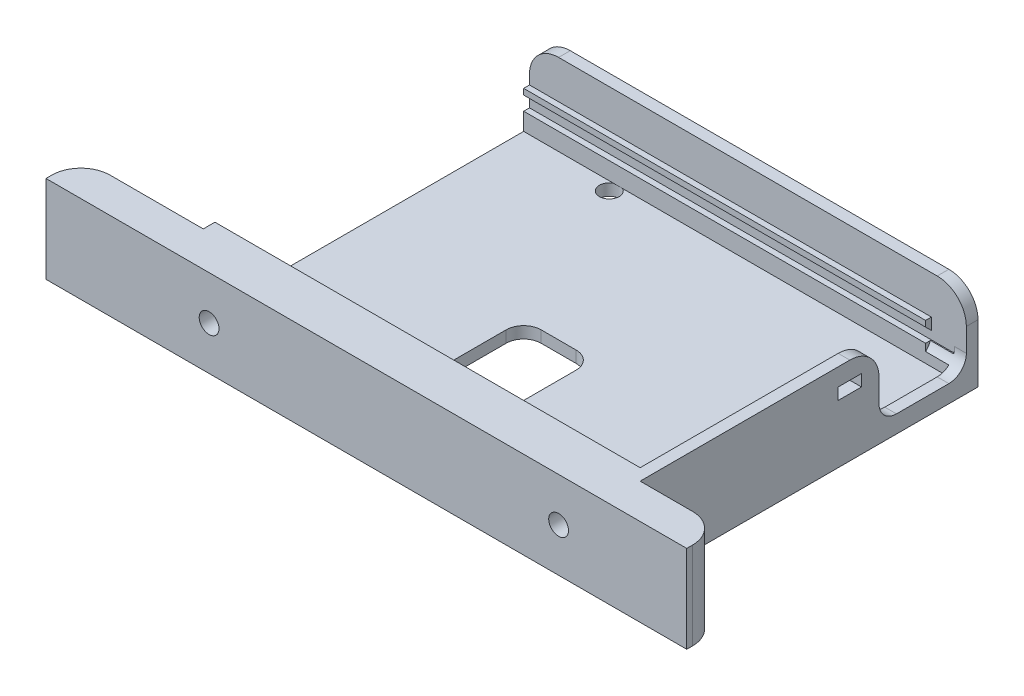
ISO-10303-21;
HEADER;
FILE_DESCRIPTION(('STEP AP214'),'2;1');
FILE_NAME('part.step','',(''),(''),'','','');
FILE_SCHEMA(('AUTOMOTIVE_DESIGN { 1 0 10303 214 1 1 1 1 }'));
ENDSEC;
DATA;
#1=APPLICATION_CONTEXT('core data for automotive mechanical design processes');
#2=APPLICATION_PROTOCOL_DEFINITION('international standard','automotive_design',2000,#1);
#3=PRODUCT_CONTEXT('',#1,'mechanical');
#4=PRODUCT('Part','Part','',(#3));
#5=PRODUCT_RELATED_PRODUCT_CATEGORY('part','',(#4));
#6=PRODUCT_DEFINITION_FORMATION('','',#4);
#7=PRODUCT_DEFINITION_CONTEXT('part definition',#1,'design');
#8=PRODUCT_DEFINITION('design','',#6,#7);
#9=PRODUCT_DEFINITION_SHAPE('','',#8);
#10=(LENGTH_UNIT() NAMED_UNIT(*) SI_UNIT(.MILLI.,.METRE.));
#11=(NAMED_UNIT(*) PLANE_ANGLE_UNIT() SI_UNIT($,.RADIAN.));
#12=(NAMED_UNIT(*) SI_UNIT($,.STERADIAN.) SOLID_ANGLE_UNIT());
#13=UNCERTAINTY_MEASURE_WITH_UNIT(LENGTH_MEASURE(1.E-05),#10,'distance_accuracy_value','');
#14=(GEOMETRIC_REPRESENTATION_CONTEXT(3) GLOBAL_UNCERTAINTY_ASSIGNED_CONTEXT((#13)) GLOBAL_UNIT_ASSIGNED_CONTEXT((#10,
#11,#12)) REPRESENTATION_CONTEXT('',''));
#15=CARTESIAN_POINT('',(0.,0.,0.));
#16=DIRECTION('',(0.,0.,1.));
#17=DIRECTION('',(1.,0.,0.));
#18=AXIS2_PLACEMENT_3D('',#15,#16,#17);
#19=CARTESIAN_POINT('',(73.,2.,-56.));
#20=DIRECTION('',(1.,0.,0.));
#21=DIRECTION('',(0.,0.,-1.));
#22=AXIS2_PLACEMENT_3D('',#19,#20,#21);
#23=PLANE('',#22);
#24=DIRECTION('',(0.,0.,1.));
#25=VECTOR('',#24,1.);
#26=CARTESIAN_POINT('',(73.,6.4,-41.));
#27=LINE('',#26,#25);
#28=CARTESIAN_POINT('',(73.,6.4,-41.));
#29=VERTEX_POINT('',#28);
#30=CARTESIAN_POINT('',(73.,6.39999999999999,-2.));
#31=VERTEX_POINT('',#30);
#32=EDGE_CURVE('E906',#29,#31,#27,.T.);
#33=ORIENTED_EDGE('',*,*,#32,.F.);
#34=DIRECTION('',(0.,-1.,0.));
#35=VECTOR('',#34,1.);
#36=CARTESIAN_POINT('',(73.,2.,-41.));
#37=LINE('',#36,#35);
#38=CARTESIAN_POINT('',(73.,6.,-41.));
#39=VERTEX_POINT('',#38);
#40=EDGE_CURVE('E799',#29,#39,#37,.T.);
#41=ORIENTED_EDGE('',*,*,#40,.T.);
#42=CARTESIAN_POINT('',(73.,6.,-44.));
#43=DIRECTION('',(1.,0.,0.));
#44=DIRECTION('',(0.,0.,-1.));
#45=AXIS2_PLACEMENT_3D('',#42,#43,#44);
#46=CIRCLE('',#45,3.);
#47=CARTESIAN_POINT('',(73.,3.,-44.));
#48=VERTEX_POINT('',#47);
#49=EDGE_CURVE('E791',#39,#48,#46,.T.);
#50=ORIENTED_EDGE('',*,*,#49,.T.);
#51=DIRECTION('',(0.,0.,-1.));
#52=VECTOR('',#51,1.);
#53=CARTESIAN_POINT('',(73.,3.,-56.));
#54=LINE('',#53,#52);
#55=CARTESIAN_POINT('',(73.,3.,-53.));
#56=VERTEX_POINT('',#55);
#57=EDGE_CURVE('E796',#48,#56,#54,.T.);
#58=ORIENTED_EDGE('',*,*,#57,.T.);
#59=CARTESIAN_POINT('',(73.,6.,-53.));
#60=DIRECTION('',(1.,0.,0.));
#61=DIRECTION('',(0.,0.,-1.));
#62=AXIS2_PLACEMENT_3D('',#59,#60,#61);
#63=CIRCLE('',#62,3.);
#64=CARTESIAN_POINT('',(73.,3.76393202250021,-55.));
#65=VERTEX_POINT('',#64);
#66=EDGE_CURVE('E576',#56,#65,#63,.T.);
#67=ORIENTED_EDGE('',*,*,#66,.T.);
#68=DIRECTION('',(0.,1.,0.));
#69=VECTOR('',#68,1.);
#70=CARTESIAN_POINT('',(72.9999999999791,2.,-55.));
#71=LINE('',#70,#69);
#72=CARTESIAN_POINT('',(73.,2.,-55.));
#73=VERTEX_POINT('',#72);
#74=EDGE_CURVE('E406',#73,#65,#71,.T.);
#75=ORIENTED_EDGE('',*,*,#74,.F.);
#76=DIRECTION('',(0.,0.,-1.));
#77=VECTOR('',#76,1.);
#78=CARTESIAN_POINT('',(73.,2.,-56.));
#79=LINE('',#78,#77);
#80=CARTESIAN_POINT('',(73.,2.,-41.));
#81=VERTEX_POINT('',#80);
#82=EDGE_CURVE('E428',#81,#73,#79,.T.);
#83=ORIENTED_EDGE('',*,*,#82,.F.);
#84=DIRECTION('',(0.,-1.,0.));
#85=VECTOR('',#84,1.);
#86=CARTESIAN_POINT('',(73.,5.,-41.));
#87=LINE('',#86,#85);
#88=CARTESIAN_POINT('',(73.,5.,-41.));
#89=VERTEX_POINT('',#88);
#90=EDGE_CURVE('E933',#89,#81,#87,.T.);
#91=ORIENTED_EDGE('',*,*,#90,.F.);
#92=DIRECTION('',(0.,0.,-1.));
#93=VECTOR('',#92,1.);
#94=CARTESIAN_POINT('',(72.9999999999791,5.00000000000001,-2.00000000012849));
#95=LINE('',#94,#93);
#96=CARTESIAN_POINT('',(73.,5.,-2.));
#97=VERTEX_POINT('',#96);
#98=EDGE_CURVE('E646',#97,#89,#95,.T.);
#99=ORIENTED_EDGE('',*,*,#98,.F.);
#100=DIRECTION('',(0.,1.,0.));
#101=VECTOR('',#100,1.);
#102=CARTESIAN_POINT('',(73.,2.,-2.));
#103=LINE('',#102,#101);
#104=EDGE_CURVE('E439',#97,#31,#103,.T.);
#105=ORIENTED_EDGE('',*,*,#104,.T.);
#106=EDGE_LOOP('',(#33,#41,#50,#58,#67,#75,#83,#91,#99,#105));
#107=FACE_BOUND('',#106,.T.);
#108=ADVANCED_FACE('F35',(#107),#23,.F.);
#109=DIRECTION('',(0.,0.,1.));
#110=VECTOR('',#109,1.);
#111=CARTESIAN_POINT('',(73.,10.,-38.));
#112=LINE('',#111,#110);
#113=CARTESIAN_POINT('',(73.,10.,-38.));
#114=VERTEX_POINT('',#113);
#115=CARTESIAN_POINT('',(73.,10.,-34.));
#116=VERTEX_POINT('',#115);
#117=EDGE_CURVE('E507',#114,#116,#112,.T.);
#118=ORIENTED_EDGE('',*,*,#117,.F.);
#119=DIRECTION('',(0.,-1.,0.));
#120=VECTOR('',#119,1.);
#121=CARTESIAN_POINT('',(73.,12.,-38.));
#122=LINE('',#121,#120);
#123=CARTESIAN_POINT('',(73.,12.,-38.));
#124=VERTEX_POINT('',#123);
#125=EDGE_CURVE('E511',#124,#114,#122,.T.);
#126=ORIENTED_EDGE('',*,*,#125,.F.);
#127=DIRECTION('',(0.,0.,-1.));
#128=VECTOR('',#127,1.);
#129=CARTESIAN_POINT('',(73.,12.,-38.));
#130=LINE('',#129,#128);
#131=CARTESIAN_POINT('',(73.,12.,-34.));
#132=VERTEX_POINT('',#131);
#133=EDGE_CURVE('E528',#132,#124,#130,.T.);
#134=ORIENTED_EDGE('',*,*,#133,.F.);
#135=DIRECTION('',(0.,1.,0.));
#136=VECTOR('',#135,1.);
#137=CARTESIAN_POINT('',(73.,12.,-34.));
#138=LINE('',#137,#136);
#139=EDGE_CURVE('E505',#116,#132,#138,.T.);
#140=ORIENTED_EDGE('',*,*,#139,.F.);
#141=EDGE_LOOP('',(#118,#126,#134,#140));
#142=FACE_BOUND('',#141,.T.);
#143=CARTESIAN_POINT('',(73.,10.,-41.));
#144=VERTEX_POINT('',#143);
#145=CARTESIAN_POINT('',(73.,8.4,-41.));
#146=VERTEX_POINT('',#145);
#147=EDGE_CURVE('E800',#144,#146,#37,.T.);
#148=ORIENTED_EDGE('',*,*,#147,.T.);
#149=DIRECTION('',(0.,0.,-1.));
#150=VECTOR('',#149,1.);
#151=CARTESIAN_POINT('',(72.9999999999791,8.4,-2.0000000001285));
#152=LINE('',#151,#150);
#153=CARTESIAN_POINT('',(73.,8.4,-2.));
#154=VERTEX_POINT('',#153);
#155=EDGE_CURVE('E652',#154,#146,#152,.T.);
#156=ORIENTED_EDGE('',*,*,#155,.F.);
#157=CARTESIAN_POINT('',(73.,15.,-2.));
#158=VERTEX_POINT('',#157);
#159=EDGE_CURVE('E442',#154,#158,#103,.T.);
#160=ORIENTED_EDGE('',*,*,#159,.T.);
#161=DIRECTION('',(0.,0.,-1.));
#162=VECTOR('',#161,1.);
#163=CARTESIAN_POINT('',(73.,15.,-56.));
#164=LINE('',#163,#162);
#165=CARTESIAN_POINT('',(73.,15.,-36.));
#166=VERTEX_POINT('',#165);
#167=EDGE_CURVE('E421',#158,#166,#164,.T.);
#168=ORIENTED_EDGE('',*,*,#167,.T.);
#169=CARTESIAN_POINT('',(73.,10.,-36.));
#170=DIRECTION('',(1.,0.,0.));
#171=DIRECTION('',(0.,0.,-1.));
#172=AXIS2_PLACEMENT_3D('',#169,#170,#171);
#173=CIRCLE('',#172,5.);
#174=EDGE_CURVE('E484',#166,#144,#173,.F.);
#175=ORIENTED_EDGE('',*,*,#174,.T.);
#176=EDGE_LOOP('',(#148,#156,#160,#168,#175));
#177=FACE_BOUND('',#176,.T.);
#178=ADVANCED_FACE('F831',(#142,#177),#23,.F.);
#179=CARTESIAN_POINT('',(500000.,6.40000000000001,-2.00000000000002));
#180=DIRECTION('',(0.,-0.707106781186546,-0.707106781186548));
#181=DIRECTION('',(0.,0.707106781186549,-0.707106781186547));
#182=AXIS2_PLACEMENT_3D('',#179,#180,#181);
#183=PLANE('',#182);
#184=DIRECTION('',(-1.,0.,0.));
#185=VECTOR('',#184,1.);
#186=CARTESIAN_POINT('',(500000.,7.4,-3.00000000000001));
#187=LINE('',#186,#185);
#188=CARTESIAN_POINT('',(72.0000000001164,7.4,-3.00000000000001));
#189=VERTEX_POINT('',#188);
#190=CARTESIAN_POINT('',(0.,7.4,-3.00000000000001));
#191=VERTEX_POINT('',#190);
#192=EDGE_CURVE('E677',#189,#191,#187,.T.);
#193=ORIENTED_EDGE('',*,*,#192,.F.);
#194=DIRECTION('',(0.,-0.707106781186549,0.707106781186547));
#195=VECTOR('',#194,1.);
#196=CARTESIAN_POINT('',(72.0000000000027,6.3999999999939,-1.99999999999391));
#197=LINE('',#196,#195);
#198=CARTESIAN_POINT('',(72.0000000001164,6.40000000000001,-2.00000000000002));
#199=VERTEX_POINT('',#198);
#200=EDGE_CURVE('E931',#189,#199,#197,.T.);
#201=ORIENTED_EDGE('',*,*,#200,.T.);
#202=DIRECTION('',(-1.,0.,0.));
#203=VECTOR('',#202,1.);
#204=CARTESIAN_POINT('',(500000.,6.40000000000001,-2.00000000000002));
#205=LINE('',#204,#203);
#206=CARTESIAN_POINT('',(0.,6.40000000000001,-2.));
#207=VERTEX_POINT('',#206);
#208=EDGE_CURVE('E679',#199,#207,#205,.T.);
#209=ORIENTED_EDGE('',*,*,#208,.T.);
#210=DIRECTION('',(0.,-0.707106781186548,0.707106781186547));
#211=VECTOR('',#210,1.);
#212=CARTESIAN_POINT('',(0.,6.40000000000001,-2.00000000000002));
#213=LINE('',#212,#211);
#214=EDGE_CURVE('E667',#191,#207,#213,.T.);
#215=ORIENTED_EDGE('',*,*,#214,.F.);
#216=EDGE_LOOP('',(#193,#201,#209,#215));
#217=FACE_BOUND('',#216,.T.);
#218=ADVANCED_FACE('F970',(#217),#183,.T.);
#219=CARTESIAN_POINT('',(500000.,7.4,-3.00000000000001));
#220=DIRECTION('',(0.,0.,-1.));
#221=DIRECTION('',(-1.,0.,0.));
#222=AXIS2_PLACEMENT_3D('',#219,#220,#221);
#223=PLANE('',#222);
#224=DIRECTION('',(-1.,0.,0.));
#225=VECTOR('',#224,1.);
#226=CARTESIAN_POINT('',(500000.,8.4,-3.00000000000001));
#227=LINE('',#226,#225);
#228=CARTESIAN_POINT('',(72.0000000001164,8.4,-3.00000000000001));
#229=VERTEX_POINT('',#228);
#230=CARTESIAN_POINT('',(0.,8.4,-3.00000000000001));
#231=VERTEX_POINT('',#230);
#232=EDGE_CURVE('E675',#229,#231,#227,.T.);
#233=ORIENTED_EDGE('',*,*,#232,.F.);
#234=DIRECTION('',(0.,-1.,0.));
#235=VECTOR('',#234,1.);
#236=CARTESIAN_POINT('',(72.0000000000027,7.4,-3.00000000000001));
#237=LINE('',#236,#235);
#238=EDGE_CURVE('E910',#229,#189,#237,.T.);
#239=ORIENTED_EDGE('',*,*,#238,.T.);
#240=ORIENTED_EDGE('',*,*,#192,.T.);
#241=DIRECTION('',(0.,-1.,0.));
#242=VECTOR('',#241,1.);
#243=CARTESIAN_POINT('',(0.,7.4,-3.00000000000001));
#244=LINE('',#243,#242);
#245=EDGE_CURVE('E663',#231,#191,#244,.T.);
#246=ORIENTED_EDGE('',*,*,#245,.F.);
#247=EDGE_LOOP('',(#233,#239,#240,#246));
#248=FACE_BOUND('',#247,.T.);
#249=ADVANCED_FACE('F1441',(#248),#223,.T.);
#250=CARTESIAN_POINT('',(0.,2.,0.));
#251=DIRECTION('',(0.,1.,0.));
#252=DIRECTION('',(0.,0.,1.));
#253=AXIS2_PLACEMENT_3D('',#250,#251,#252);
#254=PLANE('',#253);
#255=CARTESIAN_POINT('',(16.2,2.,-53.5));
#256=DIRECTION('',(0.,1.,0.));
#257=DIRECTION('',(0.,0.,1.));
#258=AXIS2_PLACEMENT_3D('',#255,#256,#257);
#259=CIRCLE('',#258,1.69999999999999);
#260=CARTESIAN_POINT('',(15.4,2.,-55.));
#261=VERTEX_POINT('',#260);
#262=CARTESIAN_POINT('',(17.0000000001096,2.,-55.));
#263=VERTEX_POINT('',#262);
#264=EDGE_CURVE('E392',#261,#263,#259,.T.);
#265=ORIENTED_EDGE('',*,*,#264,.F.);
#266=DIRECTION('',(-1.,0.,0.));
#267=VECTOR('',#266,1.);
#268=CARTESIAN_POINT('',(500000.,2.,-55.));
#269=LINE('',#268,#267);
#270=CARTESIAN_POINT('',(0.,2.,-55.));
#271=VERTEX_POINT('',#270);
#272=EDGE_CURVE('E387',#261,#271,#269,.T.);
#273=ORIENTED_EDGE('',*,*,#272,.T.);
#274=DIRECTION('',(0.,0.,1.));
#275=VECTOR('',#274,1.);
#276=CARTESIAN_POINT('',(0.,2.,-56.));
#277=LINE('',#276,#275);
#278=CARTESIAN_POINT('',(0.,2.,-3.));
#279=VERTEX_POINT('',#278);
#280=EDGE_CURVE('E423',#271,#279,#277,.T.);
#281=ORIENTED_EDGE('',*,*,#280,.T.);
#282=DIRECTION('',(-1.,0.,0.));
#283=VECTOR('',#282,1.);
#284=CARTESIAN_POINT('',(500000.,2.,-3.));
#285=LINE('',#284,#283);
#286=CARTESIAN_POINT('',(72.,2.,-3.));
#287=VERTEX_POINT('',#286);
#288=EDGE_CURVE('E656',#287,#279,#285,.T.);
#289=ORIENTED_EDGE('',*,*,#288,.F.);
#290=DIRECTION('',(0.,0.,1.));
#291=VECTOR('',#290,1.);
#292=CARTESIAN_POINT('',(72.,2.,-41.));
#293=LINE('',#292,#291);
#294=CARTESIAN_POINT('',(72.,2.,-41.));
#295=VERTEX_POINT('',#294);
#296=EDGE_CURVE('E711',#295,#287,#293,.T.);
#297=ORIENTED_EDGE('',*,*,#296,.F.);
#298=DIRECTION('',(-1.,0.,0.));
#299=VECTOR('',#298,1.);
#300=CARTESIAN_POINT('',(72.,2.,-41.));
#301=LINE('',#300,#299);
#302=EDGE_CURVE('E935',#81,#295,#301,.T.);
#303=ORIENTED_EDGE('',*,*,#302,.F.);
#304=ORIENTED_EDGE('',*,*,#82,.T.);
#305=EDGE_CURVE('E386',#73,#263,#269,.T.);
#306=ORIENTED_EDGE('',*,*,#305,.T.);
#307=EDGE_LOOP('',(#265,#273,#281,#289,#297,#303,#304,#306));
#308=FACE_BOUND('',#307,.T.);
#309=CARTESIAN_POINT('',(37.,2.,-10.));
#310=DIRECTION('',(0.,1.,0.));
#311=DIRECTION('',(0.,0.,1.));
#312=AXIS2_PLACEMENT_3D('',#309,#310,#311);
#313=CIRCLE('',#312,3.);
#314=CARTESIAN_POINT('',(40.,2.,-10.));
#315=VERTEX_POINT('',#314);
#316=CARTESIAN_POINT('',(37.,2.,-7.));
#317=VERTEX_POINT('',#316);
#318=EDGE_CURVE('E600',#315,#317,#313,.F.);
#319=ORIENTED_EDGE('',*,*,#318,.T.);
#320=DIRECTION('',(-1.,0.,0.));
#321=VECTOR('',#320,1.);
#322=CARTESIAN_POINT('',(31.,2.,-7.));
#323=LINE('',#322,#321);
#324=CARTESIAN_POINT('',(31.,2.,-7.));
#325=VERTEX_POINT('',#324);
#326=EDGE_CURVE('E629',#317,#325,#323,.T.);
#327=ORIENTED_EDGE('',*,*,#326,.T.);
#328=CARTESIAN_POINT('',(31.,2.,-10.));
#329=DIRECTION('',(0.,1.,0.));
#330=DIRECTION('',(0.,0.,1.));
#331=AXIS2_PLACEMENT_3D('',#328,#329,#330);
#332=CIRCLE('',#331,3.);
#333=CARTESIAN_POINT('',(28.,2.,-10.));
#334=VERTEX_POINT('',#333);
#335=EDGE_CURVE('E582',#325,#334,#332,.F.);
#336=ORIENTED_EDGE('',*,*,#335,.T.);
#337=DIRECTION('',(0.,0.,-1.));
#338=VECTOR('',#337,1.);
#339=CARTESIAN_POINT('',(28.,2.,-10.));
#340=LINE('',#339,#338);
#341=CARTESIAN_POINT('',(28.,2.,-24.));
#342=VERTEX_POINT('',#341);
#343=EDGE_CURVE('E585',#334,#342,#340,.T.);
#344=ORIENTED_EDGE('',*,*,#343,.T.);
#345=CARTESIAN_POINT('',(31.,2.,-24.));
#346=DIRECTION('',(0.,1.,0.));
#347=DIRECTION('',(0.,0.,1.));
#348=AXIS2_PLACEMENT_3D('',#345,#346,#347);
#349=CIRCLE('',#348,3.);
#350=CARTESIAN_POINT('',(31.,2.,-27.));
#351=VERTEX_POINT('',#350);
#352=EDGE_CURVE('E588',#342,#351,#349,.F.);
#353=ORIENTED_EDGE('',*,*,#352,.T.);
#354=DIRECTION('',(1.,0.,0.));
#355=VECTOR('',#354,1.);
#356=CARTESIAN_POINT('',(31.,2.,-27.));
#357=LINE('',#356,#355);
#358=CARTESIAN_POINT('',(37.,2.,-27.));
#359=VERTEX_POINT('',#358);
#360=EDGE_CURVE('E591',#351,#359,#357,.T.);
#361=ORIENTED_EDGE('',*,*,#360,.T.);
#362=CARTESIAN_POINT('',(37.,2.,-24.));
#363=DIRECTION('',(0.,1.,0.));
#364=DIRECTION('',(0.,0.,1.));
#365=AXIS2_PLACEMENT_3D('',#362,#363,#364);
#366=CIRCLE('',#365,3.);
#367=CARTESIAN_POINT('',(40.,2.,-24.));
#368=VERTEX_POINT('',#367);
#369=EDGE_CURVE('E594',#359,#368,#366,.F.);
#370=ORIENTED_EDGE('',*,*,#369,.T.);
#371=DIRECTION('',(0.,0.,1.));
#372=VECTOR('',#371,1.);
#373=CARTESIAN_POINT('',(40.,2.,-10.));
#374=LINE('',#373,#372);
#375=EDGE_CURVE('E597',#368,#315,#374,.T.);
#376=ORIENTED_EDGE('',*,*,#375,.T.);
#377=EDGE_LOOP('',(#319,#327,#336,#344,#353,#361,#370,#376));
#378=FACE_BOUND('',#377,.T.);
#379=ADVANCED_FACE('F396',(#308,#378),#254,.T.);
#380=CARTESIAN_POINT('',(500000.,2.,-3.));
#381=DIRECTION('',(0.,0.,-1.));
#382=DIRECTION('',(-1.,0.,0.));
#383=AXIS2_PLACEMENT_3D('',#380,#381,#382);
#384=PLANE('',#383);
#385=DIRECTION('',(-1.,0.,0.));
#386=VECTOR('',#385,1.);
#387=CARTESIAN_POINT('',(500000.,5.00000000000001,-3.));
#388=LINE('',#387,#386);
#389=CARTESIAN_POINT('',(72.0000000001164,5.00000000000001,-3.));
#390=VERTEX_POINT('',#389);
#391=CARTESIAN_POINT('',(0.,5.00000000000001,-3.));
#392=VERTEX_POINT('',#391);
#393=EDGE_CURVE('E658',#390,#392,#388,.T.);
#394=ORIENTED_EDGE('',*,*,#393,.F.);
#395=DIRECTION('',(0.,-1.,0.));
#396=VECTOR('',#395,1.);
#397=CARTESIAN_POINT('',(72.0000000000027,2.,-3.));
#398=LINE('',#397,#396);
#399=EDGE_CURVE('E503',#390,#287,#398,.T.);
#400=ORIENTED_EDGE('',*,*,#399,.T.);
#401=ORIENTED_EDGE('',*,*,#288,.T.);
#402=DIRECTION('',(0.,-1.,0.));
#403=VECTOR('',#402,1.);
#404=CARTESIAN_POINT('',(0.,2.,-3.));
#405=LINE('',#404,#403);
#406=EDGE_CURVE('E649',#392,#279,#405,.T.);
#407=ORIENTED_EDGE('',*,*,#406,.F.);
#408=EDGE_LOOP('',(#394,#400,#401,#407));
#409=FACE_BOUND('',#408,.T.);
#410=ADVANCED_FACE('F715',(#409),#384,.T.);
#411=CARTESIAN_POINT('',(0.,15.,0.));
#412=DIRECTION('',(0.,-1.,0.));
#413=DIRECTION('',(0.,0.,-1.));
#414=AXIS2_PLACEMENT_3D('',#411,#412,#413);
#415=PLANE('',#414);
#416=DIRECTION('',(-1.,0.,0.));
#417=VECTOR('',#416,1.);
#418=CARTESIAN_POINT('',(-21.,15.,0.));
#419=LINE('',#418,#417);
#420=CARTESIAN_POINT('',(0.,15.,0.));
#421=VERTEX_POINT('',#420);
#422=CARTESIAN_POINT('',(-16.,15.,0.));
#423=VERTEX_POINT('',#422);
#424=EDGE_CURVE('E488',#421,#423,#419,.T.);
#425=ORIENTED_EDGE('',*,*,#424,.T.);
#426=CARTESIAN_POINT('',(-16.,15.,5.));
#427=DIRECTION('',(0.,-1.,0.));
#428=DIRECTION('',(0.,0.,-1.));
#429=AXIS2_PLACEMENT_3D('',#426,#427,#428);
#430=CIRCLE('',#429,5.);
#431=CARTESIAN_POINT('',(-21.,15.,5.));
#432=VERTEX_POINT('',#431);
#433=EDGE_CURVE('E757',#423,#432,#430,.F.);
#434=ORIENTED_EDGE('',*,*,#433,.T.);
#435=DIRECTION('',(0.,0.,-1.));
#436=VECTOR('',#435,1.);
#437=CARTESIAN_POINT('',(-21.,15.,6.));
#438=LINE('',#437,#436);
#439=CARTESIAN_POINT('',(-21.,15.,6.));
#440=VERTEX_POINT('',#439);
#441=EDGE_CURVE('E733',#440,#432,#438,.T.);
#442=ORIENTED_EDGE('',*,*,#441,.F.);
#443=DIRECTION('',(-1.,0.,0.));
#444=VECTOR('',#443,1.);
#445=CARTESIAN_POINT('',(-21.,15.,6.));
#446=LINE('',#445,#444);
#447=CARTESIAN_POINT('',(89.,15.,6.));
#448=VERTEX_POINT('',#447);
#449=EDGE_CURVE('E494',#448,#440,#446,.T.);
#450=ORIENTED_EDGE('',*,*,#449,.F.);
#451=DIRECTION('',(0.,0.,-1.));
#452=VECTOR('',#451,1.);
#453=CARTESIAN_POINT('',(89.,15.,6.));
#454=LINE('',#453,#452);
#455=CARTESIAN_POINT('',(89.,15.,5.));
#456=VERTEX_POINT('',#455);
#457=EDGE_CURVE('E737',#448,#456,#454,.T.);
#458=ORIENTED_EDGE('',*,*,#457,.T.);
#459=CARTESIAN_POINT('',(84.,15.,5.));
#460=DIRECTION('',(0.,-1.,0.));
#461=DIRECTION('',(0.,0.,-1.));
#462=AXIS2_PLACEMENT_3D('',#459,#460,#461);
#463=CIRCLE('',#462,5.);
#464=CARTESIAN_POINT('',(84.,15.,0.));
#465=VERTEX_POINT('',#464);
#466=EDGE_CURVE('E50',#456,#465,#463,.F.);
#467=ORIENTED_EDGE('',*,*,#466,.T.);
#468=CARTESIAN_POINT('',(75.,15.,0.));
#469=VERTEX_POINT('',#468);
#470=EDGE_CURVE('E728',#465,#469,#419,.T.);
#471=ORIENTED_EDGE('',*,*,#470,.T.);
#472=DIRECTION('',(0.,0.,-1.));
#473=VECTOR('',#472,1.);
#474=CARTESIAN_POINT('',(75.,15.,0.));
#475=LINE('',#474,#473);
#476=CARTESIAN_POINT('',(75.,15.,-36.));
#477=VERTEX_POINT('',#476);
#478=EDGE_CURVE('E449',#469,#477,#475,.T.);
#479=ORIENTED_EDGE('',*,*,#478,.T.);
#480=DIRECTION('',(1.,0.,0.));
#481=VECTOR('',#480,1.);
#482=CARTESIAN_POINT('',(0.,15.,-36.));
#483=LINE('',#482,#481);
#484=EDGE_CURVE('E825',#477,#166,#483,.F.);
#485=ORIENTED_EDGE('',*,*,#484,.T.);
#486=ORIENTED_EDGE('',*,*,#167,.F.);
#487=DIRECTION('',(1.,0.,0.));
#488=VECTOR('',#487,1.);
#489=CARTESIAN_POINT('',(2.00000000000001,15.,-2.));
#490=LINE('',#489,#488);
#491=CARTESIAN_POINT('',(0.,15.,-2.));
#492=VERTEX_POINT('',#491);
#493=EDGE_CURVE('E431',#492,#158,#490,.T.);
#494=ORIENTED_EDGE('',*,*,#493,.F.);
#495=DIRECTION('',(0.,0.,1.));
#496=VECTOR('',#495,1.);
#497=CARTESIAN_POINT('',(0.,15.,0.));
#498=LINE('',#497,#496);
#499=EDGE_CURVE('E453',#492,#421,#498,.T.);
#500=ORIENTED_EDGE('',*,*,#499,.T.);
#501=EDGE_LOOP('',(#425,#434,#442,#450,#458,#467,#471,#479,#485,#486,#494,#500));
#502=FACE_BOUND('',#501,.T.);
#503=ADVANCED_FACE('F767',(#502),#415,.F.);
#504=DIRECTION('',(0.,0.,-1.));
#505=VECTOR('',#504,1.);
#506=CARTESIAN_POINT('',(72.9999999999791,5.00000000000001,-56.0000000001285));
#507=LINE('',#506,#505);
#508=CARTESIAN_POINT('',(73.,5.00000000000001,-55.8284271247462));
#509=VERTEX_POINT('',#508);
#510=CARTESIAN_POINT('',(73.,5.,-56.));
#511=VERTEX_POINT('',#510);
#512=EDGE_CURVE('E405',#509,#511,#507,.T.);
#513=ORIENTED_EDGE('',*,*,#512,.F.);
#514=CARTESIAN_POINT('',(73.,6.,-56.));
#515=VERTEX_POINT('',#514);
#516=EDGE_CURVE('E580',#509,#515,#63,.T.);
#517=ORIENTED_EDGE('',*,*,#516,.T.);
#518=DIRECTION('',(0.,1.,0.));
#519=VECTOR('',#518,1.);
#520=CARTESIAN_POINT('',(73.,2.,-56.));
#521=LINE('',#520,#519);
#522=EDGE_CURVE('E430',#511,#515,#521,.T.);
#523=ORIENTED_EDGE('',*,*,#522,.F.);
#524=EDGE_LOOP('',(#513,#517,#523));
#525=FACE_BOUND('',#524,.T.);
#526=ADVANCED_FACE('F887',(#525),#23,.F.);
#527=CARTESIAN_POINT('',(500000.,8.4,-56.));
#528=DIRECTION('',(0.,1.,0.));
#529=DIRECTION('',(0.,0.,1.));
#530=AXIS2_PLACEMENT_3D('',#527,#528,#529);
#531=PLANE('',#530);
#532=DIRECTION('',(-1.,0.,0.));
#533=VECTOR('',#532,1.);
#534=CARTESIAN_POINT('',(500000.,8.4,-55.));
#535=LINE('',#534,#533);
#536=CARTESIAN_POINT('',(69.0000000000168,8.4,-55.));
#537=VERTEX_POINT('',#536);
#538=CARTESIAN_POINT('',(0.,8.4,-55.));
#539=VERTEX_POINT('',#538);
#540=EDGE_CURVE('E693',#537,#539,#535,.T.);
#541=ORIENTED_EDGE('',*,*,#540,.F.);
#542=DIRECTION('',(0.,0.,-1.));
#543=VECTOR('',#542,1.);
#544=CARTESIAN_POINT('',(69.0000000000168,8.4,-56.));
#545=LINE('',#544,#543);
#546=CARTESIAN_POINT('',(69.,8.4,-56.));
#547=VERTEX_POINT('',#546);
#548=EDGE_CURVE('E568',#537,#547,#545,.T.);
#549=ORIENTED_EDGE('',*,*,#548,.T.);
#550=DIRECTION('',(-1.,0.,0.));
#551=VECTOR('',#550,1.);
#552=CARTESIAN_POINT('',(500000.,8.4,-56.));
#553=LINE('',#552,#551);
#554=CARTESIAN_POINT('',(0.,8.40000000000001,-56.));
#555=VERTEX_POINT('',#554);
#556=EDGE_CURVE('E695',#547,#555,#553,.T.);
#557=ORIENTED_EDGE('',*,*,#556,.T.);
#558=DIRECTION('',(0.,0.,-1.));
#559=VECTOR('',#558,1.);
#560=CARTESIAN_POINT('',(0.,8.4,-56.));
#561=LINE('',#560,#559);
#562=EDGE_CURVE('E682',#539,#555,#561,.T.);
#563=ORIENTED_EDGE('',*,*,#562,.F.);
#564=EDGE_LOOP('',(#541,#549,#557,#563));
#565=FACE_BOUND('',#564,.T.);
#566=ADVANCED_FACE('F874',(#565),#531,.T.);
#567=CARTESIAN_POINT('',(500000.,7.4,-55.));
#568=DIRECTION('',(0.,0.,1.));
#569=DIRECTION('',(1.,0.,0.));
#570=AXIS2_PLACEMENT_3D('',#567,#568,#569);
#571=PLANE('',#570);
#572=DIRECTION('',(-1.,0.,0.));
#573=VECTOR('',#572,1.);
#574=CARTESIAN_POINT('',(500000.,7.4,-55.));
#575=LINE('',#574,#573);
#576=CARTESIAN_POINT('',(69.0000000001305,7.4,-55.));
#577=VERTEX_POINT('',#576);
#578=CARTESIAN_POINT('',(0.,7.4,-55.));
#579=VERTEX_POINT('',#578);
#580=EDGE_CURVE('E673',#577,#579,#575,.T.);
#581=ORIENTED_EDGE('',*,*,#580,.F.);
#582=DIRECTION('',(0.,1.,0.));
#583=VECTOR('',#582,1.);
#584=CARTESIAN_POINT('',(69.0000000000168,7.4,-55.));
#585=LINE('',#584,#583);
#586=EDGE_CURVE('E559',#577,#537,#585,.T.);
#587=ORIENTED_EDGE('',*,*,#586,.T.);
#588=ORIENTED_EDGE('',*,*,#540,.T.);
#589=DIRECTION('',(0.,1.,0.));
#590=VECTOR('',#589,1.);
#591=CARTESIAN_POINT('',(0.,7.4,-55.));
#592=LINE('',#591,#590);
#593=EDGE_CURVE('E685',#579,#539,#592,.T.);
#594=ORIENTED_EDGE('',*,*,#593,.F.);
#595=EDGE_LOOP('',(#581,#587,#588,#594));
#596=FACE_BOUND('',#595,.T.);
#597=ADVANCED_FACE('F979',(#596),#571,.T.);
#598=CARTESIAN_POINT('',(500000.,6.40000000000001,-56.));
#599=DIRECTION('',(0.,-0.707106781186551,0.707106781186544));
#600=DIRECTION('',(0.,-0.707106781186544,-0.707106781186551));
#601=AXIS2_PLACEMENT_3D('',#598,#599,#600);
#602=PLANE('',#601);
#603=DIRECTION('',(-1.,0.,0.));
#604=VECTOR('',#603,1.);
#605=CARTESIAN_POINT('',(500000.,6.40000000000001,-56.));
#606=LINE('',#605,#604);
#607=CARTESIAN_POINT('',(69.0000000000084,6.40000000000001,-56.));
#608=VERTEX_POINT('',#607);
#609=CARTESIAN_POINT('',(0.,6.40000000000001,-56.));
#610=VERTEX_POINT('',#609);
#611=EDGE_CURVE('E686',#608,#610,#606,.T.);
#612=ORIENTED_EDGE('',*,*,#611,.F.);
#613=DIRECTION('',(0.,0.707106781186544,0.707106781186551));
#614=VECTOR('',#613,1.);
#615=CARTESIAN_POINT('',(69.0000000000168,6.40000000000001,-56.));
#616=LINE('',#615,#614);
#617=EDGE_CURVE('E785',#608,#577,#616,.T.);
#618=ORIENTED_EDGE('',*,*,#617,.T.);
#619=ORIENTED_EDGE('',*,*,#580,.T.);
#620=DIRECTION('',(0.,0.707106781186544,0.707106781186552));
#621=VECTOR('',#620,1.);
#622=CARTESIAN_POINT('',(0.,6.40000000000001,-56.));
#623=LINE('',#622,#621);
#624=EDGE_CURVE('E687',#610,#579,#623,.T.);
#625=ORIENTED_EDGE('',*,*,#624,.F.);
#626=EDGE_LOOP('',(#612,#618,#619,#625));
#627=FACE_BOUND('',#626,.T.);
#628=ADVANCED_FACE('F878',(#627),#602,.T.);
#629=CARTESIAN_POINT('',(2.00000000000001,2.,-2.));
#630=DIRECTION('',(0.,0.,1.));
#631=DIRECTION('',(1.,0.,0.));
#632=AXIS2_PLACEMENT_3D('',#629,#630,#631);
#633=PLANE('',#632);
#634=ORIENTED_EDGE('',*,*,#104,.F.);
#635=DIRECTION('',(-1.,0.,0.));
#636=VECTOR('',#635,1.);
#637=CARTESIAN_POINT('',(500000.,5.00000000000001,-2.00000000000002));
#638=LINE('',#637,#636);
#639=CARTESIAN_POINT('',(0.,5.00000000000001,-2.));
#640=VERTEX_POINT('',#639);
#641=EDGE_CURVE('E648',#97,#640,#638,.T.);
#642=ORIENTED_EDGE('',*,*,#641,.T.);
#643=DIRECTION('',(0.,1.,0.));
#644=VECTOR('',#643,1.);
#645=CARTESIAN_POINT('',(0.,15.,-2.));
#646=LINE('',#645,#644);
#647=EDGE_CURVE('E418',#640,#207,#646,.T.);
#648=ORIENTED_EDGE('',*,*,#647,.T.);
#649=ORIENTED_EDGE('',*,*,#208,.F.);
#650=EDGE_CURVE('E670',#31,#199,#205,.T.);
#651=ORIENTED_EDGE('',*,*,#650,.F.);
#652=EDGE_LOOP('',(#634,#642,#648,#649,#651));
#653=FACE_BOUND('',#652,.T.);
#654=ADVANCED_FACE('F1003',(#653),#633,.F.);
#655=CARTESIAN_POINT('',(0.,15.,0.));
#656=DIRECTION('',(1.,0.,0.));
#657=DIRECTION('',(0.,0.,-1.));
#658=AXIS2_PLACEMENT_3D('',#655,#656,#657);
#659=PLANE('',#658);
#660=DIRECTION('',(0.,-1.,0.));
#661=VECTOR('',#660,1.);
#662=CARTESIAN_POINT('',(0.,15.,-56.));
#663=LINE('',#662,#661);
#664=CARTESIAN_POINT('',(0.,10.,-56.));
#665=VERTEX_POINT('',#664);
#666=EDGE_CURVE('E425',#665,#555,#663,.T.);
#667=ORIENTED_EDGE('',*,*,#666,.F.);
#668=DIRECTION('',(0.,0.,1.));
#669=VECTOR('',#668,1.);
#670=CARTESIAN_POINT('',(0.,10.,0.));
#671=LINE('',#670,#669);
#672=CARTESIAN_POINT('',(0.,10.,-58.));
#673=VERTEX_POINT('',#672);
#674=EDGE_CURVE('E813',#665,#673,#671,.F.);
#675=ORIENTED_EDGE('',*,*,#674,.T.);
#676=DIRECTION('',(0.,-1.,0.));
#677=VECTOR('',#676,1.);
#678=CARTESIAN_POINT('',(0.,15.,-58.));
#679=LINE('',#678,#677);
#680=CARTESIAN_POINT('',(0.,0.,-58.));
#681=VERTEX_POINT('',#680);
#682=EDGE_CURVE('E448',#673,#681,#679,.T.);
#683=ORIENTED_EDGE('',*,*,#682,.T.);
#684=DIRECTION('',(0.,0.,1.));
#685=VECTOR('',#684,1.);
#686=CARTESIAN_POINT('',(0.,0.,0.));
#687=LINE('',#686,#685);
#688=CARTESIAN_POINT('',(0.,0.,0.));
#689=VERTEX_POINT('',#688);
#690=EDGE_CURVE('E441',#681,#689,#687,.T.);
#691=ORIENTED_EDGE('',*,*,#690,.T.);
#692=DIRECTION('',(0.,-1.,0.));
#693=VECTOR('',#692,1.);
#694=CARTESIAN_POINT('',(0.,15.,0.));
#695=LINE('',#694,#693);
#696=EDGE_CURVE('E466',#421,#689,#695,.T.);
#697=ORIENTED_EDGE('',*,*,#696,.F.);
#698=ORIENTED_EDGE('',*,*,#499,.F.);
#699=CARTESIAN_POINT('',(0.,8.4,-2.00000000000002));
#700=VERTEX_POINT('',#699);
#701=EDGE_CURVE('E422',#700,#492,#646,.T.);
#702=ORIENTED_EDGE('',*,*,#701,.F.);
#703=DIRECTION('',(0.,0.,-1.));
#704=VECTOR('',#703,1.);
#705=CARTESIAN_POINT('',(0.,8.4,-2.00000000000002));
#706=LINE('',#705,#704);
#707=EDGE_CURVE('E666',#700,#231,#706,.T.);
#708=ORIENTED_EDGE('',*,*,#707,.T.);
#709=ORIENTED_EDGE('',*,*,#245,.T.);
#710=ORIENTED_EDGE('',*,*,#214,.T.);
#711=ORIENTED_EDGE('',*,*,#647,.F.);
#712=DIRECTION('',(0.,0.,-1.));
#713=VECTOR('',#712,1.);
#714=CARTESIAN_POINT('',(0.,5.00000000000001,-2.00000000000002));
#715=LINE('',#714,#713);
#716=EDGE_CURVE('E653',#640,#392,#715,.T.);
#717=ORIENTED_EDGE('',*,*,#716,.T.);
#718=ORIENTED_EDGE('',*,*,#406,.T.);
#719=ORIENTED_EDGE('',*,*,#280,.F.);
#720=DIRECTION('',(0.,1.,0.));
#721=VECTOR('',#720,1.);
#722=CARTESIAN_POINT('',(0.,2.,-55.));
#723=LINE('',#722,#721);
#724=CARTESIAN_POINT('',(0.,5.00000000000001,-55.));
#725=VERTEX_POINT('',#724);
#726=EDGE_CURVE('E404',#271,#725,#723,.T.);
#727=ORIENTED_EDGE('',*,*,#726,.T.);
#728=DIRECTION('',(0.,0.,-1.));
#729=VECTOR('',#728,1.);
#730=CARTESIAN_POINT('',(0.,5.00000000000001,-56.));
#731=LINE('',#730,#729);
#732=CARTESIAN_POINT('',(0.,5.00000000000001,-56.));
#733=VERTEX_POINT('',#732);
#734=EDGE_CURVE('E701',#725,#733,#731,.T.);
#735=ORIENTED_EDGE('',*,*,#734,.T.);
#736=EDGE_CURVE('E427',#610,#733,#663,.T.);
#737=ORIENTED_EDGE('',*,*,#736,.F.);
#738=ORIENTED_EDGE('',*,*,#624,.T.);
#739=ORIENTED_EDGE('',*,*,#593,.T.);
#740=ORIENTED_EDGE('',*,*,#562,.T.);
#741=EDGE_LOOP('',(#667,#675,#683,#691,#697,#698,#702,#708,#709,#710,#711,#717,#718,#719,#727,
#735,#737,#738,#739,#740));
#742=FACE_BOUND('',#741,.T.);
#743=ADVANCED_FACE('F705',(#742),#659,.F.);
#744=CARTESIAN_POINT('',(75.,15.,0.));
#745=DIRECTION('',(-1.,0.,0.));
#746=DIRECTION('',(0.,0.,1.));
#747=AXIS2_PLACEMENT_3D('',#744,#745,#746);
#748=PLANE('',#747);
#749=DIRECTION('',(0.,0.,1.));
#750=VECTOR('',#749,1.);
#751=CARTESIAN_POINT('',(75.,12.,-38.));
#752=LINE('',#751,#750);
#753=CARTESIAN_POINT('',(75.,12.,-38.));
#754=VERTEX_POINT('',#753);
#755=CARTESIAN_POINT('',(75.,12.,-34.));
#756=VERTEX_POINT('',#755);
#757=EDGE_CURVE('E516',#754,#756,#752,.T.);
#758=ORIENTED_EDGE('',*,*,#757,.F.);
#759=DIRECTION('',(0.,1.,0.));
#760=VECTOR('',#759,1.);
#761=CARTESIAN_POINT('',(75.,12.,-38.));
#762=LINE('',#761,#760);
#763=CARTESIAN_POINT('',(75.,10.,-38.));
#764=VERTEX_POINT('',#763);
#765=EDGE_CURVE('E514',#764,#754,#762,.T.);
#766=ORIENTED_EDGE('',*,*,#765,.F.);
#767=DIRECTION('',(0.,0.,-1.));
#768=VECTOR('',#767,1.);
#769=CARTESIAN_POINT('',(75.,10.,-38.));
#770=LINE('',#769,#768);
#771=CARTESIAN_POINT('',(75.,10.,-34.));
#772=VERTEX_POINT('',#771);
#773=EDGE_CURVE('E522',#772,#764,#770,.T.);
#774=ORIENTED_EDGE('',*,*,#773,.F.);
#775=DIRECTION('',(0.,-1.,0.));
#776=VECTOR('',#775,1.);
#777=CARTESIAN_POINT('',(75.,12.,-34.));
#778=LINE('',#777,#776);
#779=EDGE_CURVE('E519',#756,#772,#778,.T.);
#780=ORIENTED_EDGE('',*,*,#779,.F.);
#781=EDGE_LOOP('',(#758,#766,#774,#780));
#782=FACE_BOUND('',#781,.T.);
#783=DIRECTION('',(0.,-1.,0.));
#784=VECTOR('',#783,1.);
#785=CARTESIAN_POINT('',(75.,15.,-58.));
#786=LINE('',#785,#784);
#787=CARTESIAN_POINT('',(75.,10.,-58.));
#788=VERTEX_POINT('',#787);
#789=CARTESIAN_POINT('',(75.,0.,-58.));
#790=VERTEX_POINT('',#789);
#791=EDGE_CURVE('E456',#788,#790,#786,.T.);
#792=ORIENTED_EDGE('',*,*,#791,.F.);
#793=DIRECTION('',(0.,0.,-1.));
#794=VECTOR('',#793,1.);
#795=CARTESIAN_POINT('',(75.,10.,0.));
#796=LINE('',#795,#794);
#797=CARTESIAN_POINT('',(75.,10.,-56.));
#798=VERTEX_POINT('',#797);
#799=EDGE_CURVE('E821',#788,#798,#796,.F.);
#800=ORIENTED_EDGE('',*,*,#799,.T.);
#801=DIRECTION('',(0.,1.,0.));
#802=VECTOR('',#801,1.);
#803=CARTESIAN_POINT('',(75.,15.,-56.));
#804=LINE('',#803,#802);
#805=CARTESIAN_POINT('',(75.,6.,-56.));
#806=VERTEX_POINT('',#805);
#807=EDGE_CURVE('E542',#806,#798,#804,.T.);
#808=ORIENTED_EDGE('',*,*,#807,.F.);
#809=CARTESIAN_POINT('',(75.,6.,-53.));
#810=DIRECTION('',(1.,0.,0.));
#811=DIRECTION('',(0.,0.,1.));
#812=AXIS2_PLACEMENT_3D('',#809,#810,#811);
#813=CIRCLE('',#812,3.);
#814=CARTESIAN_POINT('',(75.,3.,-53.));
#815=VERTEX_POINT('',#814);
#816=EDGE_CURVE('E552',#815,#806,#813,.T.);
#817=ORIENTED_EDGE('',*,*,#816,.F.);
#818=DIRECTION('',(0.,0.,-1.));
#819=VECTOR('',#818,1.);
#820=CARTESIAN_POINT('',(75.,3.,-44.));
#821=LINE('',#820,#819);
#822=CARTESIAN_POINT('',(75.,3.,-44.));
#823=VERTEX_POINT('',#822);
#824=EDGE_CURVE('E549',#823,#815,#821,.T.);
#825=ORIENTED_EDGE('',*,*,#824,.F.);
#826=CARTESIAN_POINT('',(75.,6.,-44.));
#827=DIRECTION('',(1.,0.,0.));
#828=DIRECTION('',(0.,0.,-1.));
#829=AXIS2_PLACEMENT_3D('',#826,#827,#828);
#830=CIRCLE('',#829,3.);
#831=CARTESIAN_POINT('',(75.,6.,-41.));
#832=VERTEX_POINT('',#831);
#833=EDGE_CURVE('E546',#832,#823,#830,.T.);
#834=ORIENTED_EDGE('',*,*,#833,.F.);
#835=DIRECTION('',(0.,-1.,0.));
#836=VECTOR('',#835,1.);
#837=CARTESIAN_POINT('',(75.,15.,-41.));
#838=LINE('',#837,#836);
#839=CARTESIAN_POINT('',(75.,10.,-41.));
#840=VERTEX_POINT('',#839);
#841=EDGE_CURVE('E537',#840,#832,#838,.T.);
#842=ORIENTED_EDGE('',*,*,#841,.F.);
#843=CARTESIAN_POINT('',(75.,10.,-36.));
#844=DIRECTION('',(-1.,0.,0.));
#845=DIRECTION('',(0.,0.,1.));
#846=AXIS2_PLACEMENT_3D('',#843,#844,#845);
#847=CIRCLE('',#846,5.);
#848=EDGE_CURVE('E819',#840,#477,#847,.F.);
#849=ORIENTED_EDGE('',*,*,#848,.T.);
#850=ORIENTED_EDGE('',*,*,#478,.F.);
#851=DIRECTION('',(0.,-1.,0.));
#852=VECTOR('',#851,1.);
#853=CARTESIAN_POINT('',(75.,15.,0.));
#854=LINE('',#853,#852);
#855=CARTESIAN_POINT('',(75.,0.,0.));
#856=VERTEX_POINT('',#855);
#857=EDGE_CURVE('E458',#469,#856,#854,.T.);
#858=ORIENTED_EDGE('',*,*,#857,.T.);
#859=DIRECTION('',(0.,0.,-1.));
#860=VECTOR('',#859,1.);
#861=CARTESIAN_POINT('',(75.,0.,0.));
#862=LINE('',#861,#860);
#863=EDGE_CURVE('E454',#856,#790,#862,.T.);
#864=ORIENTED_EDGE('',*,*,#863,.T.);
#865=EDGE_LOOP('',(#792,#800,#808,#817,#825,#834,#842,#849,#850,#858,#864));
#866=FACE_BOUND('',#865,.T.);
#867=ADVANCED_FACE('F844',(#782,#866),#748,.F.);
#868=CARTESIAN_POINT('',(0.,15.,-58.));
#869=DIRECTION('',(0.,0.,1.));
#870=DIRECTION('',(1.,0.,0.));
#871=AXIS2_PLACEMENT_3D('',#868,#869,#870);
#872=PLANE('',#871);
#873=ORIENTED_EDGE('',*,*,#682,.F.);
#874=CARTESIAN_POINT('',(5.,10.,-58.));
#875=DIRECTION('',(0.,0.,1.));
#876=DIRECTION('',(1.,0.,0.));
#877=AXIS2_PLACEMENT_3D('',#874,#875,#876);
#878=CIRCLE('',#877,5.);
#879=CARTESIAN_POINT('',(5.,15.,-58.));
#880=VERTEX_POINT('',#879);
#881=EDGE_CURVE('E817',#673,#880,#878,.F.);
#882=ORIENTED_EDGE('',*,*,#881,.T.);
#883=DIRECTION('',(-1.,0.,0.));
#884=VECTOR('',#883,1.);
#885=CARTESIAN_POINT('',(0.,15.,-58.));
#886=LINE('',#885,#884);
#887=CARTESIAN_POINT('',(70.,15.,-58.));
#888=VERTEX_POINT('',#887);
#889=EDGE_CURVE('E445',#888,#880,#886,.T.);
#890=ORIENTED_EDGE('',*,*,#889,.F.);
#891=CARTESIAN_POINT('',(70.,10.,-58.));
#892=DIRECTION('',(0.,0.,1.));
#893=DIRECTION('',(1.,0.,0.));
#894=AXIS2_PLACEMENT_3D('',#891,#892,#893);
#895=CIRCLE('',#894,5.);
#896=EDGE_CURVE('E815',#888,#788,#895,.F.);
#897=ORIENTED_EDGE('',*,*,#896,.T.);
#898=ORIENTED_EDGE('',*,*,#791,.T.);
#899=DIRECTION('',(-1.,0.,0.));
#900=VECTOR('',#899,1.);
#901=CARTESIAN_POINT('',(0.,0.,-58.));
#902=LINE('',#901,#900);
#903=EDGE_CURVE('E450',#790,#681,#902,.T.);
#904=ORIENTED_EDGE('',*,*,#903,.T.);
#905=EDGE_LOOP('',(#873,#882,#890,#897,#898,#904));
#906=FACE_BOUND('',#905,.T.);
#907=ADVANCED_FACE('F987',(#906),#872,.F.);
#908=ORIENTED_EDGE('',*,*,#889,.T.);
#909=DIRECTION('',(0.,0.,1.));
#910=VECTOR('',#909,1.);
#911=CARTESIAN_POINT('',(5.,15.,0.));
#912=LINE('',#911,#910);
#913=CARTESIAN_POINT('',(5.,15.,-56.));
#914=VERTEX_POINT('',#913);
#915=EDGE_CURVE('E806',#880,#914,#912,.T.);
#916=ORIENTED_EDGE('',*,*,#915,.T.);
#917=DIRECTION('',(-1.,0.,0.));
#918=VECTOR('',#917,1.);
#919=CARTESIAN_POINT('',(2.,15.,-56.));
#920=LINE('',#919,#918);
#921=CARTESIAN_POINT('',(70.,15.,-56.));
#922=VERTEX_POINT('',#921);
#923=EDGE_CURVE('E434',#922,#914,#920,.T.);
#924=ORIENTED_EDGE('',*,*,#923,.F.);
#925=DIRECTION('',(0.,0.,-1.));
#926=VECTOR('',#925,1.);
#927=CARTESIAN_POINT('',(70.,15.,0.));
#928=LINE('',#927,#926);
#929=EDGE_CURVE('E803',#922,#888,#928,.T.);
#930=ORIENTED_EDGE('',*,*,#929,.T.);
#931=EDGE_LOOP('',(#908,#916,#924,#930));
#932=FACE_BOUND('',#931,.T.);
#933=ADVANCED_FACE('F862',(#932),#415,.F.);
#934=CARTESIAN_POINT('',(0.,0.,0.));
#935=DIRECTION('',(0.,-1.,0.));
#936=DIRECTION('',(0.,0.,-1.));
#937=AXIS2_PLACEMENT_3D('',#934,#935,#936);
#938=PLANE('',#937);
#939=CARTESIAN_POINT('',(16.2,0.,-53.5));
#940=DIRECTION('',(0.,-1.,0.));
#941=DIRECTION('',(0.,0.,-1.));
#942=AXIS2_PLACEMENT_3D('',#939,#940,#941);
#943=CIRCLE('',#942,1.69999999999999);
#944=CARTESIAN_POINT('',(16.2,0.,-55.2));
#945=VERTEX_POINT('',#944);
#946=EDGE_CURVE('E393',#945,#945,#943,.T.);
#947=ORIENTED_EDGE('',*,*,#946,.F.);
#948=EDGE_LOOP('',(#947));
#949=FACE_BOUND('',#948,.T.);
#950=CARTESIAN_POINT('',(37.,0.,-10.));
#951=DIRECTION('',(0.,-1.,0.));
#952=DIRECTION('',(0.,0.,-1.));
#953=AXIS2_PLACEMENT_3D('',#950,#951,#952);
#954=CIRCLE('',#953,3.);
#955=CARTESIAN_POINT('',(40.,0.,-10.));
#956=VERTEX_POINT('',#955);
#957=CARTESIAN_POINT('',(37.,0.,-7.));
#958=VERTEX_POINT('',#957);
#959=EDGE_CURVE('E603',#956,#958,#954,.T.);
#960=ORIENTED_EDGE('',*,*,#959,.F.);
#961=DIRECTION('',(0.,0.,1.));
#962=VECTOR('',#961,1.);
#963=CARTESIAN_POINT('',(40.,0.,-10.));
#964=LINE('',#963,#962);
#965=CARTESIAN_POINT('',(40.,0.,-24.));
#966=VERTEX_POINT('',#965);
#967=EDGE_CURVE('E623',#966,#956,#964,.T.);
#968=ORIENTED_EDGE('',*,*,#967,.F.);
#969=CARTESIAN_POINT('',(37.,0.,-24.));
#970=DIRECTION('',(0.,-1.,0.));
#971=DIRECTION('',(0.,0.,1.));
#972=AXIS2_PLACEMENT_3D('',#969,#970,#971);
#973=CIRCLE('',#972,3.);
#974=CARTESIAN_POINT('',(37.,0.,-27.));
#975=VERTEX_POINT('',#974);
#976=EDGE_CURVE('E620',#975,#966,#973,.T.);
#977=ORIENTED_EDGE('',*,*,#976,.F.);
#978=DIRECTION('',(1.,0.,0.));
#979=VECTOR('',#978,1.);
#980=CARTESIAN_POINT('',(31.,0.,-27.));
#981=LINE('',#980,#979);
#982=CARTESIAN_POINT('',(31.,0.,-27.));
#983=VERTEX_POINT('',#982);
#984=EDGE_CURVE('E617',#983,#975,#981,.T.);
#985=ORIENTED_EDGE('',*,*,#984,.F.);
#986=CARTESIAN_POINT('',(31.,0.,-24.));
#987=DIRECTION('',(0.,-1.,0.));
#988=DIRECTION('',(0.,0.,-1.));
#989=AXIS2_PLACEMENT_3D('',#986,#987,#988);
#990=CIRCLE('',#989,3.);
#991=CARTESIAN_POINT('',(28.,0.,-24.));
#992=VERTEX_POINT('',#991);
#993=EDGE_CURVE('E614',#992,#983,#990,.T.);
#994=ORIENTED_EDGE('',*,*,#993,.F.);
#995=DIRECTION('',(0.,0.,-1.));
#996=VECTOR('',#995,1.);
#997=CARTESIAN_POINT('',(28.,0.,-10.));
#998=LINE('',#997,#996);
#999=CARTESIAN_POINT('',(28.,0.,-10.));
#1000=VERTEX_POINT('',#999);
#1001=EDGE_CURVE('E611',#1000,#992,#998,.T.);
#1002=ORIENTED_EDGE('',*,*,#1001,.F.);
#1003=CARTESIAN_POINT('',(31.,0.,-10.));
#1004=DIRECTION('',(0.,-1.,0.));
#1005=DIRECTION('',(0.,0.,-1.));
#1006=AXIS2_PLACEMENT_3D('',#1003,#1004,#1005);
#1007=CIRCLE('',#1006,3.);
#1008=CARTESIAN_POINT('',(31.,0.,-7.));
#1009=VERTEX_POINT('',#1008);
#1010=EDGE_CURVE('E608',#1009,#1000,#1007,.T.);
#1011=ORIENTED_EDGE('',*,*,#1010,.F.);
#1012=DIRECTION('',(-1.,0.,0.));
#1013=VECTOR('',#1012,1.);
#1014=CARTESIAN_POINT('',(31.,0.,-7.));
#1015=LINE('',#1014,#1013);
#1016=EDGE_CURVE('E605',#958,#1009,#1015,.T.);
#1017=ORIENTED_EDGE('',*,*,#1016,.F.);
#1018=EDGE_LOOP('',(#960,#968,#977,#985,#994,#1002,#1011,#1017));
#1019=FACE_BOUND('',#1018,.T.);
#1020=DIRECTION('',(0.,0.,-1.));
#1021=VECTOR('',#1020,1.);
#1022=CARTESIAN_POINT('',(-21.,0.,6.));
#1023=LINE('',#1022,#1021);
#1024=CARTESIAN_POINT('',(-21.,0.,6.));
#1025=VERTEX_POINT('',#1024);
#1026=CARTESIAN_POINT('',(-21.,0.,5.));
#1027=VERTEX_POINT('',#1026);
#1028=EDGE_CURVE('E508',#1025,#1027,#1023,.T.);
#1029=ORIENTED_EDGE('',*,*,#1028,.T.);
#1030=CARTESIAN_POINT('',(-16.,0.,5.));
#1031=DIRECTION('',(0.,-1.,0.));
#1032=DIRECTION('',(0.,0.,-1.));
#1033=AXIS2_PLACEMENT_3D('',#1030,#1031,#1032);
#1034=CIRCLE('',#1033,5.);
#1035=CARTESIAN_POINT('',(-16.,0.,0.));
#1036=VERTEX_POINT('',#1035);
#1037=EDGE_CURVE('E749',#1027,#1036,#1034,.T.);
#1038=ORIENTED_EDGE('',*,*,#1037,.T.);
#1039=DIRECTION('',(1.,0.,0.));
#1040=VECTOR('',#1039,1.);
#1041=CARTESIAN_POINT('',(-21.,0.,0.));
#1042=LINE('',#1041,#1040);
#1043=EDGE_CURVE('E485',#1036,#689,#1042,.T.);
#1044=ORIENTED_EDGE('',*,*,#1043,.T.);
#1045=ORIENTED_EDGE('',*,*,#690,.F.);
#1046=ORIENTED_EDGE('',*,*,#903,.F.);
#1047=ORIENTED_EDGE('',*,*,#863,.F.);
#1048=CARTESIAN_POINT('',(84.,0.,0.));
#1049=VERTEX_POINT('',#1048);
#1050=EDGE_CURVE('E489',#856,#1049,#1042,.T.);
#1051=ORIENTED_EDGE('',*,*,#1050,.T.);
#1052=CARTESIAN_POINT('',(84.,0.,5.));
#1053=DIRECTION('',(0.,-1.,0.));
#1054=DIRECTION('',(0.,0.,-1.));
#1055=AXIS2_PLACEMENT_3D('',#1052,#1053,#1054);
#1056=CIRCLE('',#1055,5.);
#1057=CARTESIAN_POINT('',(89.,0.,5.));
#1058=VERTEX_POINT('',#1057);
#1059=EDGE_CURVE('E483',#1049,#1058,#1056,.T.);
#1060=ORIENTED_EDGE('',*,*,#1059,.T.);
#1061=DIRECTION('',(0.,0.,-1.));
#1062=VECTOR('',#1061,1.);
#1063=CARTESIAN_POINT('',(89.,0.,6.));
#1064=LINE('',#1063,#1062);
#1065=CARTESIAN_POINT('',(89.,0.,6.));
#1066=VERTEX_POINT('',#1065);
#1067=EDGE_CURVE('E741',#1066,#1058,#1064,.T.);
#1068=ORIENTED_EDGE('',*,*,#1067,.F.);
#1069=DIRECTION('',(1.,0.,0.));
#1070=VECTOR('',#1069,1.);
#1071=CARTESIAN_POINT('',(-21.,0.,6.));
#1072=LINE('',#1071,#1070);
#1073=EDGE_CURVE('E727',#1025,#1066,#1072,.T.);
#1074=ORIENTED_EDGE('',*,*,#1073,.F.);
#1075=EDGE_LOOP('',(#1029,#1038,#1044,#1045,#1046,#1047,#1051,#1060,#1068,#1074));
#1076=FACE_BOUND('',#1075,.T.);
#1077=ADVANCED_FACE('F748',(#949,#1019,#1076),#938,.T.);
#1078=ORIENTED_EDGE('',*,*,#159,.F.);
#1079=DIRECTION('',(-1.,0.,0.));
#1080=VECTOR('',#1079,1.);
#1081=CARTESIAN_POINT('',(500000.,8.4,-2.00000000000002));
#1082=LINE('',#1081,#1080);
#1083=EDGE_CURVE('E662',#154,#700,#1082,.T.);
#1084=ORIENTED_EDGE('',*,*,#1083,.T.);
#1085=ORIENTED_EDGE('',*,*,#701,.T.);
#1086=ORIENTED_EDGE('',*,*,#493,.T.);
#1087=EDGE_LOOP('',(#1078,#1084,#1085,#1086));
#1088=FACE_BOUND('',#1087,.T.);
#1089=ADVANCED_FACE('F992',(#1088),#633,.F.);
#1090=CARTESIAN_POINT('',(2.,2.,-56.));
#1091=DIRECTION('',(0.,0.,-1.));
#1092=DIRECTION('',(-1.,0.,0.));
#1093=AXIS2_PLACEMENT_3D('',#1090,#1091,#1092);
#1094=PLANE('',#1093);
#1095=ORIENTED_EDGE('',*,*,#923,.T.);
#1096=CARTESIAN_POINT('',(5.,10.,-56.));
#1097=DIRECTION('',(0.,0.,-1.));
#1098=DIRECTION('',(-1.,0.,0.));
#1099=AXIS2_PLACEMENT_3D('',#1096,#1097,#1098);
#1100=CIRCLE('',#1099,5.);
#1101=EDGE_CURVE('E811',#914,#665,#1100,.F.);
#1102=ORIENTED_EDGE('',*,*,#1101,.T.);
#1103=ORIENTED_EDGE('',*,*,#666,.T.);
#1104=ORIENTED_EDGE('',*,*,#556,.F.);
#1105=DIRECTION('',(0.,1.,0.));
#1106=VECTOR('',#1105,1.);
#1107=CARTESIAN_POINT('',(69.,15.,-56.));
#1108=LINE('',#1107,#1106);
#1109=EDGE_CURVE('E541',#608,#547,#1108,.T.);
#1110=ORIENTED_EDGE('',*,*,#1109,.F.);
#1111=ORIENTED_EDGE('',*,*,#611,.T.);
#1112=ORIENTED_EDGE('',*,*,#736,.T.);
#1113=DIRECTION('',(-1.,0.,0.));
#1114=VECTOR('',#1113,1.);
#1115=CARTESIAN_POINT('',(500000.,5.00000000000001,-56.));
#1116=LINE('',#1115,#1114);
#1117=EDGE_CURVE('E411',#511,#733,#1116,.T.);
#1118=ORIENTED_EDGE('',*,*,#1117,.F.);
#1119=ORIENTED_EDGE('',*,*,#522,.T.);
#1120=DIRECTION('',(1.,0.,0.));
#1121=VECTOR('',#1120,1.);
#1122=CARTESIAN_POINT('',(69.,6.,-56.));
#1123=LINE('',#1122,#1121);
#1124=EDGE_CURVE('E557',#515,#806,#1123,.T.);
#1125=ORIENTED_EDGE('',*,*,#1124,.T.);
#1126=ORIENTED_EDGE('',*,*,#807,.T.);
#1127=CARTESIAN_POINT('',(70.,10.,-56.));
#1128=DIRECTION('',(0.,0.,-1.));
#1129=DIRECTION('',(-1.,0.,0.));
#1130=AXIS2_PLACEMENT_3D('',#1127,#1128,#1129);
#1131=CIRCLE('',#1130,5.);
#1132=EDGE_CURVE('E809',#798,#922,#1131,.F.);
#1133=ORIENTED_EDGE('',*,*,#1132,.T.);
#1134=EDGE_LOOP('',(#1095,#1102,#1103,#1104,#1110,#1111,#1112,#1118,#1119,#1125,#1126,#1133));
#1135=FACE_BOUND('',#1134,.T.);
#1136=ADVANCED_FACE('F860',(#1135),#1094,.F.);
#1137=CARTESIAN_POINT('',(500000.,5.00000000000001,-56.));
#1138=DIRECTION('',(0.,1.,0.));
#1139=DIRECTION('',(0.,0.,1.));
#1140=AXIS2_PLACEMENT_3D('',#1137,#1138,#1139);
#1141=PLANE('',#1140);
#1142=DIRECTION('',(1.,0.,0.));
#1143=VECTOR('',#1142,1.);
#1144=CARTESIAN_POINT('',(69.,5.00000000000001,-55.8284271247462));
#1145=LINE('',#1144,#1143);
#1146=CARTESIAN_POINT('',(69.,5.00000000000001,-55.8284271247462));
#1147=VERTEX_POINT('',#1146);
#1148=EDGE_CURVE('E579',#509,#1147,#1145,.F.);
#1149=ORIENTED_EDGE('',*,*,#1148,.F.);
#1150=ORIENTED_EDGE('',*,*,#512,.T.);
#1151=ORIENTED_EDGE('',*,*,#1117,.T.);
#1152=ORIENTED_EDGE('',*,*,#734,.F.);
#1153=DIRECTION('',(-1.,0.,0.));
#1154=VECTOR('',#1153,1.);
#1155=CARTESIAN_POINT('',(500000.,5.00000000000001,-55.));
#1156=LINE('',#1155,#1154);
#1157=CARTESIAN_POINT('',(69.0000000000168,5.,-55.));
#1158=VERTEX_POINT('',#1157);
#1159=EDGE_CURVE('E410',#1158,#725,#1156,.T.);
#1160=ORIENTED_EDGE('',*,*,#1159,.F.);
#1161=DIRECTION('',(0.,0.,-1.));
#1162=VECTOR('',#1161,1.);
#1163=CARTESIAN_POINT('',(69.0000000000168,5.00000000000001,-56.));
#1164=LINE('',#1163,#1162);
#1165=EDGE_CURVE('E573',#1158,#1147,#1164,.T.);
#1166=ORIENTED_EDGE('',*,*,#1165,.T.);
#1167=EDGE_LOOP('',(#1149,#1150,#1151,#1152,#1160,#1166));
#1168=FACE_BOUND('',#1167,.T.);
#1169=ADVANCED_FACE('F883',(#1168),#1141,.T.);
#1170=CARTESIAN_POINT('',(500000.,2.,-55.));
#1171=DIRECTION('',(0.,0.,1.));
#1172=DIRECTION('',(1.,0.,0.));
#1173=AXIS2_PLACEMENT_3D('',#1170,#1171,#1172);
#1174=PLANE('',#1173);
#1175=DIRECTION('',(1.,0.,0.));
#1176=VECTOR('',#1175,1.);
#1177=CARTESIAN_POINT('',(69.,3.76393202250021,-55.));
#1178=LINE('',#1177,#1176);
#1179=CARTESIAN_POINT('',(69.,3.76393202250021,-55.));
#1180=VERTEX_POINT('',#1179);
#1181=EDGE_CURVE('E787',#1180,#65,#1178,.T.);
#1182=ORIENTED_EDGE('',*,*,#1181,.F.);
#1183=DIRECTION('',(0.,1.,0.));
#1184=VECTOR('',#1183,1.);
#1185=CARTESIAN_POINT('',(69.0000000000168,2.,-55.));
#1186=LINE('',#1185,#1184);
#1187=EDGE_CURVE('E571',#1180,#1158,#1186,.T.);
#1188=ORIENTED_EDGE('',*,*,#1187,.T.);
#1189=ORIENTED_EDGE('',*,*,#1159,.T.);
#1190=ORIENTED_EDGE('',*,*,#726,.F.);
#1191=ORIENTED_EDGE('',*,*,#272,.F.);
#1192=EDGE_CURVE('E377',#263,#261,#269,.T.);
#1193=ORIENTED_EDGE('',*,*,#1192,.F.);
#1194=ORIENTED_EDGE('',*,*,#305,.F.);
#1195=ORIENTED_EDGE('',*,*,#74,.T.);
#1196=EDGE_LOOP('',(#1182,#1188,#1189,#1190,#1191,#1193,#1194,#1195));
#1197=FACE_BOUND('',#1196,.T.);
#1198=ADVANCED_FACE('F402',(#1197),#1174,.T.);
#1199=CARTESIAN_POINT('',(500000.,8.4,-2.00000000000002));
#1200=DIRECTION('',(0.,1.,0.));
#1201=DIRECTION('',(0.,0.,1.));
#1202=AXIS2_PLACEMENT_3D('',#1199,#1200,#1201);
#1203=PLANE('',#1202);
#1204=ORIENTED_EDGE('',*,*,#155,.T.);
#1205=DIRECTION('',(1.,0.,0.));
#1206=VECTOR('',#1205,1.);
#1207=CARTESIAN_POINT('',(73.,8.4,-41.));
#1208=LINE('',#1207,#1206);
#1209=CARTESIAN_POINT('',(72.,8.4,-41.));
#1210=VERTEX_POINT('',#1209);
#1211=EDGE_CURVE('E839',#1210,#146,#1208,.T.);
#1212=ORIENTED_EDGE('',*,*,#1211,.F.);
#1213=DIRECTION('',(0.,0.,1.));
#1214=VECTOR('',#1213,1.);
#1215=CARTESIAN_POINT('',(72.,8.4,-41.));
#1216=LINE('',#1215,#1214);
#1217=EDGE_CURVE('E926',#1210,#229,#1216,.T.);
#1218=ORIENTED_EDGE('',*,*,#1217,.T.);
#1219=ORIENTED_EDGE('',*,*,#232,.T.);
#1220=ORIENTED_EDGE('',*,*,#707,.F.);
#1221=ORIENTED_EDGE('',*,*,#1083,.F.);
#1222=EDGE_LOOP('',(#1204,#1212,#1218,#1219,#1220,#1221));
#1223=FACE_BOUND('',#1222,.T.);
#1224=ADVANCED_FACE('F1210',(#1223),#1203,.T.);
#1225=CARTESIAN_POINT('',(500000.,5.00000000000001,-2.00000000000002));
#1226=DIRECTION('',(0.,1.,0.));
#1227=DIRECTION('',(0.,0.,1.));
#1228=AXIS2_PLACEMENT_3D('',#1225,#1226,#1227);
#1229=PLANE('',#1228);
#1230=ORIENTED_EDGE('',*,*,#98,.T.);
#1231=DIRECTION('',(1.,0.,0.));
#1232=VECTOR('',#1231,1.);
#1233=CARTESIAN_POINT('',(73.,5.,-41.));
#1234=LINE('',#1233,#1232);
#1235=CARTESIAN_POINT('',(72.,5.,-41.));
#1236=VERTEX_POINT('',#1235);
#1237=EDGE_CURVE('E939',#1236,#89,#1234,.T.);
#1238=ORIENTED_EDGE('',*,*,#1237,.F.);
#1239=DIRECTION('',(0.,0.,1.));
#1240=VECTOR('',#1239,1.);
#1241=CARTESIAN_POINT('',(72.,5.,-41.));
#1242=LINE('',#1241,#1240);
#1243=EDGE_CURVE('E720',#1236,#390,#1242,.T.);
#1244=ORIENTED_EDGE('',*,*,#1243,.T.);
#1245=ORIENTED_EDGE('',*,*,#393,.T.);
#1246=ORIENTED_EDGE('',*,*,#716,.F.);
#1247=ORIENTED_EDGE('',*,*,#641,.F.);
#1248=EDGE_LOOP('',(#1230,#1238,#1244,#1245,#1246,#1247));
#1249=FACE_BOUND('',#1248,.T.);
#1250=ADVANCED_FACE('F943',(#1249),#1229,.T.);
#1251=CARTESIAN_POINT('',(37.,15.001,-10.));
#1252=DIRECTION('',(0.,-1.,0.));
#1253=DIRECTION('',(0.,0.,-1.));
#1254=AXIS2_PLACEMENT_3D('',#1251,#1252,#1253);
#1255=CYLINDRICAL_SURFACE('',#1254,3.);
#1256=DIRECTION('',(0.,-1.,0.));
#1257=VECTOR('',#1256,1.);
#1258=CARTESIAN_POINT('',(40.,15.001,-10.));
#1259=LINE('',#1258,#1257);
#1260=EDGE_CURVE('E627',#315,#956,#1259,.T.);
#1261=ORIENTED_EDGE('',*,*,#1260,.T.);
#1262=ORIENTED_EDGE('',*,*,#959,.T.);
#1263=DIRECTION('',(0.,-1.,0.));
#1264=VECTOR('',#1263,1.);
#1265=CARTESIAN_POINT('',(37.,15.001,-7.));
#1266=LINE('',#1265,#1264);
#1267=EDGE_CURVE('E626',#317,#958,#1266,.T.);
#1268=ORIENTED_EDGE('',*,*,#1267,.F.);
#1269=ORIENTED_EDGE('',*,*,#318,.F.);
#1270=EDGE_LOOP('',(#1261,#1262,#1268,#1269));
#1271=FACE_BOUND('',#1270,.T.);
#1272=ADVANCED_FACE('F1227',(#1271),#1255,.F.);
#1273=CARTESIAN_POINT('',(40.,15.001,-10.));
#1274=DIRECTION('',(1.,0.,0.));
#1275=DIRECTION('',(0.,0.,-1.));
#1276=AXIS2_PLACEMENT_3D('',#1273,#1274,#1275);
#1277=PLANE('',#1276);
#1278=DIRECTION('',(0.,-1.,0.));
#1279=VECTOR('',#1278,1.);
#1280=CARTESIAN_POINT('',(40.,15.001,-24.));
#1281=LINE('',#1280,#1279);
#1282=EDGE_CURVE('E630',#368,#966,#1281,.T.);
#1283=ORIENTED_EDGE('',*,*,#1282,.T.);
#1284=ORIENTED_EDGE('',*,*,#967,.T.);
#1285=ORIENTED_EDGE('',*,*,#1260,.F.);
#1286=ORIENTED_EDGE('',*,*,#375,.F.);
#1287=EDGE_LOOP('',(#1283,#1284,#1285,#1286));
#1288=FACE_BOUND('',#1287,.T.);
#1289=ADVANCED_FACE('F1234',(#1288),#1277,.F.);
#1290=CARTESIAN_POINT('',(37.,15.001,-24.));
#1291=DIRECTION('',(0.,-1.,0.));
#1292=DIRECTION('',(0.,0.,-1.));
#1293=AXIS2_PLACEMENT_3D('',#1290,#1291,#1292);
#1294=CYLINDRICAL_SURFACE('',#1293,3.);
#1295=DIRECTION('',(0.,-1.,0.));
#1296=VECTOR('',#1295,1.);
#1297=CARTESIAN_POINT('',(37.,15.001,-27.));
#1298=LINE('',#1297,#1296);
#1299=EDGE_CURVE('E632',#359,#975,#1298,.T.);
#1300=ORIENTED_EDGE('',*,*,#1299,.T.);
#1301=ORIENTED_EDGE('',*,*,#976,.T.);
#1302=ORIENTED_EDGE('',*,*,#1282,.F.);
#1303=ORIENTED_EDGE('',*,*,#369,.F.);
#1304=EDGE_LOOP('',(#1300,#1301,#1302,#1303));
#1305=FACE_BOUND('',#1304,.T.);
#1306=ADVANCED_FACE('F1242',(#1305),#1294,.F.);
#1307=CARTESIAN_POINT('',(31.,15.001,-27.));
#1308=DIRECTION('',(0.,0.,-1.));
#1309=DIRECTION('',(-1.,0.,0.));
#1310=AXIS2_PLACEMENT_3D('',#1307,#1308,#1309);
#1311=PLANE('',#1310);
#1312=DIRECTION('',(0.,-1.,0.));
#1313=VECTOR('',#1312,1.);
#1314=CARTESIAN_POINT('',(31.,15.001,-27.));
#1315=LINE('',#1314,#1313);
#1316=EDGE_CURVE('E634',#351,#983,#1315,.T.);
#1317=ORIENTED_EDGE('',*,*,#1316,.T.);
#1318=ORIENTED_EDGE('',*,*,#984,.T.);
#1319=ORIENTED_EDGE('',*,*,#1299,.F.);
#1320=ORIENTED_EDGE('',*,*,#360,.F.);
#1321=EDGE_LOOP('',(#1317,#1318,#1319,#1320));
#1322=FACE_BOUND('',#1321,.T.);
#1323=ADVANCED_FACE('F1250',(#1322),#1311,.F.);
#1324=CARTESIAN_POINT('',(31.,15.001,-24.));
#1325=DIRECTION('',(0.,-1.,0.));
#1326=DIRECTION('',(0.,0.,-1.));
#1327=AXIS2_PLACEMENT_3D('',#1324,#1325,#1326);
#1328=CYLINDRICAL_SURFACE('',#1327,3.);
#1329=DIRECTION('',(0.,-1.,0.));
#1330=VECTOR('',#1329,1.);
#1331=CARTESIAN_POINT('',(28.,15.001,-24.));
#1332=LINE('',#1331,#1330);
#1333=EDGE_CURVE('E636',#342,#992,#1332,.T.);
#1334=ORIENTED_EDGE('',*,*,#1333,.T.);
#1335=ORIENTED_EDGE('',*,*,#993,.T.);
#1336=ORIENTED_EDGE('',*,*,#1316,.F.);
#1337=ORIENTED_EDGE('',*,*,#352,.F.);
#1338=EDGE_LOOP('',(#1334,#1335,#1336,#1337));
#1339=FACE_BOUND('',#1338,.T.);
#1340=ADVANCED_FACE('F1258',(#1339),#1328,.F.);
#1341=CARTESIAN_POINT('',(28.,15.001,-10.));
#1342=DIRECTION('',(-1.,0.,0.));
#1343=DIRECTION('',(0.,0.,1.));
#1344=AXIS2_PLACEMENT_3D('',#1341,#1342,#1343);
#1345=PLANE('',#1344);
#1346=DIRECTION('',(0.,-1.,0.));
#1347=VECTOR('',#1346,1.);
#1348=CARTESIAN_POINT('',(28.,15.001,-10.));
#1349=LINE('',#1348,#1347);
#1350=EDGE_CURVE('E638',#334,#1000,#1349,.T.);
#1351=ORIENTED_EDGE('',*,*,#1350,.T.);
#1352=ORIENTED_EDGE('',*,*,#1001,.T.);
#1353=ORIENTED_EDGE('',*,*,#1333,.F.);
#1354=ORIENTED_EDGE('',*,*,#343,.F.);
#1355=EDGE_LOOP('',(#1351,#1352,#1353,#1354));
#1356=FACE_BOUND('',#1355,.T.);
#1357=ADVANCED_FACE('F1266',(#1356),#1345,.F.);
#1358=CARTESIAN_POINT('',(31.,15.001,-10.));
#1359=DIRECTION('',(0.,-1.,0.));
#1360=DIRECTION('',(0.,0.,-1.));
#1361=AXIS2_PLACEMENT_3D('',#1358,#1359,#1360);
#1362=CYLINDRICAL_SURFACE('',#1361,3.);
#1363=DIRECTION('',(0.,-1.,0.));
#1364=VECTOR('',#1363,1.);
#1365=CARTESIAN_POINT('',(31.,15.001,-7.));
#1366=LINE('',#1365,#1364);
#1367=EDGE_CURVE('E640',#325,#1009,#1366,.T.);
#1368=ORIENTED_EDGE('',*,*,#1367,.T.);
#1369=ORIENTED_EDGE('',*,*,#1010,.T.);
#1370=ORIENTED_EDGE('',*,*,#1350,.F.);
#1371=ORIENTED_EDGE('',*,*,#335,.F.);
#1372=EDGE_LOOP('',(#1368,#1369,#1370,#1371));
#1373=FACE_BOUND('',#1372,.T.);
#1374=ADVANCED_FACE('F1274',(#1373),#1362,.F.);
#1375=CARTESIAN_POINT('',(31.,15.001,-7.));
#1376=DIRECTION('',(0.,0.,1.));
#1377=DIRECTION('',(1.,0.,0.));
#1378=AXIS2_PLACEMENT_3D('',#1375,#1376,#1377);
#1379=PLANE('',#1378);
#1380=ORIENTED_EDGE('',*,*,#1267,.T.);
#1381=ORIENTED_EDGE('',*,*,#1016,.T.);
#1382=ORIENTED_EDGE('',*,*,#1367,.F.);
#1383=ORIENTED_EDGE('',*,*,#326,.F.);
#1384=EDGE_LOOP('',(#1380,#1381,#1382,#1383));
#1385=FACE_BOUND('',#1384,.T.);
#1386=ADVANCED_FACE('F1282',(#1385),#1379,.F.);
#1387=CARTESIAN_POINT('',(69.,15.,-41.));
#1388=DIRECTION('',(0.,0.,1.));
#1389=DIRECTION('',(1.,0.,0.));
#1390=AXIS2_PLACEMENT_3D('',#1387,#1388,#1389);
#1391=PLANE('',#1390);
#1392=ORIENTED_EDGE('',*,*,#147,.F.);
#1393=DIRECTION('',(1.,0.,0.));
#1394=VECTOR('',#1393,1.);
#1395=CARTESIAN_POINT('',(69.,10.,-41.));
#1396=LINE('',#1395,#1394);
#1397=EDGE_CURVE('E823',#144,#840,#1396,.T.);
#1398=ORIENTED_EDGE('',*,*,#1397,.T.);
#1399=ORIENTED_EDGE('',*,*,#841,.T.);
#1400=DIRECTION('',(1.,0.,0.));
#1401=VECTOR('',#1400,1.);
#1402=CARTESIAN_POINT('',(69.,6.,-41.));
#1403=LINE('',#1402,#1401);
#1404=EDGE_CURVE('E544',#39,#832,#1403,.T.);
#1405=ORIENTED_EDGE('',*,*,#1404,.F.);
#1406=ORIENTED_EDGE('',*,*,#40,.F.);
#1407=DIRECTION('',(-1.,0.,0.));
#1408=VECTOR('',#1407,1.);
#1409=CARTESIAN_POINT('',(73.,6.4,-41.));
#1410=LINE('',#1409,#1408);
#1411=CARTESIAN_POINT('',(72.,6.4,-41.));
#1412=VERTEX_POINT('',#1411);
#1413=EDGE_CURVE('E902',#29,#1412,#1410,.T.);
#1414=ORIENTED_EDGE('',*,*,#1413,.T.);
#1415=DIRECTION('',(0.,1.,0.));
#1416=VECTOR('',#1415,1.);
#1417=CARTESIAN_POINT('',(72.,8.4,-41.));
#1418=LINE('',#1417,#1416);
#1419=EDGE_CURVE('E916',#1412,#1210,#1418,.T.);
#1420=ORIENTED_EDGE('',*,*,#1419,.T.);
#1421=ORIENTED_EDGE('',*,*,#1211,.T.);
#1422=EDGE_LOOP('',(#1392,#1398,#1399,#1405,#1406,#1414,#1420,#1421));
#1423=FACE_BOUND('',#1422,.T.);
#1424=ADVANCED_FACE('F836',(#1423),#1391,.F.);
#1425=CARTESIAN_POINT('',(69.,3.,-44.));
#1426=DIRECTION('',(0.,-1.,0.));
#1427=DIRECTION('',(0.,0.,-1.));
#1428=AXIS2_PLACEMENT_3D('',#1425,#1426,#1427);
#1429=PLANE('',#1428);
#1430=DIRECTION('',(1.,0.,0.));
#1431=VECTOR('',#1430,1.);
#1432=CARTESIAN_POINT('',(69.,3.,-44.));
#1433=LINE('',#1432,#1431);
#1434=EDGE_CURVE('E562',#48,#823,#1433,.T.);
#1435=ORIENTED_EDGE('',*,*,#1434,.T.);
#1436=ORIENTED_EDGE('',*,*,#824,.T.);
#1437=DIRECTION('',(1.,0.,0.));
#1438=VECTOR('',#1437,1.);
#1439=CARTESIAN_POINT('',(69.,3.,-53.));
#1440=LINE('',#1439,#1438);
#1441=EDGE_CURVE('E560',#56,#815,#1440,.T.);
#1442=ORIENTED_EDGE('',*,*,#1441,.F.);
#1443=ORIENTED_EDGE('',*,*,#57,.F.);
#1444=EDGE_LOOP('',(#1435,#1436,#1442,#1443));
#1445=FACE_BOUND('',#1444,.T.);
#1446=ADVANCED_FACE('F894',(#1445),#1429,.F.);
#1447=CARTESIAN_POINT('',(69.,6.,-44.));
#1448=DIRECTION('',(1.,0.,0.));
#1449=DIRECTION('',(0.,0.,-1.));
#1450=AXIS2_PLACEMENT_3D('',#1447,#1448,#1449);
#1451=CYLINDRICAL_SURFACE('',#1450,3.);
#1452=ORIENTED_EDGE('',*,*,#1404,.T.);
#1453=ORIENTED_EDGE('',*,*,#833,.T.);
#1454=ORIENTED_EDGE('',*,*,#1434,.F.);
#1455=ORIENTED_EDGE('',*,*,#49,.F.);
#1456=EDGE_LOOP('',(#1452,#1453,#1454,#1455));
#1457=FACE_BOUND('',#1456,.T.);
#1458=ADVANCED_FACE('F898',(#1457),#1451,.F.);
#1459=CARTESIAN_POINT('',(69.,6.,-53.));
#1460=DIRECTION('',(1.,0.,0.));
#1461=DIRECTION('',(0.,0.,-1.));
#1462=AXIS2_PLACEMENT_3D('',#1459,#1460,#1461);
#1463=CYLINDRICAL_SURFACE('',#1462,3.);
#1464=ORIENTED_EDGE('',*,*,#1148,.T.);
#1465=CARTESIAN_POINT('',(69.,6.,-53.));
#1466=DIRECTION('',(1.,0.,0.));
#1467=DIRECTION('',(0.,0.,1.));
#1468=AXIS2_PLACEMENT_3D('',#1465,#1466,#1467);
#1469=CIRCLE('',#1468,3.);
#1470=EDGE_CURVE('E538',#1180,#1147,#1469,.T.);
#1471=ORIENTED_EDGE('',*,*,#1470,.F.);
#1472=ORIENTED_EDGE('',*,*,#1181,.T.);
#1473=ORIENTED_EDGE('',*,*,#66,.F.);
#1474=ORIENTED_EDGE('',*,*,#1441,.T.);
#1475=ORIENTED_EDGE('',*,*,#816,.T.);
#1476=ORIENTED_EDGE('',*,*,#1124,.F.);
#1477=ORIENTED_EDGE('',*,*,#516,.F.);
#1478=EDGE_LOOP('',(#1464,#1471,#1472,#1473,#1474,#1475,#1476,#1477));
#1479=FACE_BOUND('',#1478,.T.);
#1480=ADVANCED_FACE('F890',(#1479),#1463,.F.);
#1481=CARTESIAN_POINT('',(69.,6.,-44.));
#1482=DIRECTION('',(1.,0.,0.));
#1483=DIRECTION('',(0.,0.,-1.));
#1484=AXIS2_PLACEMENT_3D('',#1481,#1482,#1483);
#1485=PLANE('',#1484);
#1486=ORIENTED_EDGE('',*,*,#1187,.F.);
#1487=ORIENTED_EDGE('',*,*,#1470,.T.);
#1488=ORIENTED_EDGE('',*,*,#1165,.F.);
#1489=EDGE_LOOP('',(#1486,#1487,#1488));
#1490=FACE_BOUND('',#1489,.T.);
#1491=ADVANCED_FACE('F954',(#1490),#1485,.T.);
#1492=ORIENTED_EDGE('',*,*,#586,.F.);
#1493=ORIENTED_EDGE('',*,*,#617,.F.);
#1494=ORIENTED_EDGE('',*,*,#1109,.T.);
#1495=ORIENTED_EDGE('',*,*,#548,.F.);
#1496=EDGE_LOOP('',(#1492,#1493,#1494,#1495));
#1497=FACE_BOUND('',#1496,.T.);
#1498=ADVANCED_FACE('F956',(#1497),#1485,.T.);
#1499=CARTESIAN_POINT('',(-0.001000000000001,12.,-38.));
#1500=DIRECTION('',(0.,0.,-1.));
#1501=DIRECTION('',(-1.,0.,0.));
#1502=AXIS2_PLACEMENT_3D('',#1499,#1500,#1501);
#1503=PLANE('',#1502);
#1504=ORIENTED_EDGE('',*,*,#125,.T.);
#1505=DIRECTION('',(1.,0.,0.));
#1506=VECTOR('',#1505,1.);
#1507=CARTESIAN_POINT('',(-0.001000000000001,10.,-38.));
#1508=LINE('',#1507,#1506);
#1509=EDGE_CURVE('E526',#114,#764,#1508,.T.);
#1510=ORIENTED_EDGE('',*,*,#1509,.T.);
#1511=ORIENTED_EDGE('',*,*,#765,.T.);
#1512=DIRECTION('',(1.,0.,0.));
#1513=VECTOR('',#1512,1.);
#1514=CARTESIAN_POINT('',(-0.001000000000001,12.,-38.));
#1515=LINE('',#1514,#1513);
#1516=EDGE_CURVE('E525',#124,#754,#1515,.T.);
#1517=ORIENTED_EDGE('',*,*,#1516,.F.);
#1518=EDGE_LOOP('',(#1504,#1510,#1511,#1517));
#1519=FACE_BOUND('',#1518,.T.);
#1520=ADVANCED_FACE('F962',(#1519),#1503,.F.);
#1521=CARTESIAN_POINT('',(-0.001000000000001,10.,-38.));
#1522=DIRECTION('',(0.,-1.,0.));
#1523=DIRECTION('',(0.,0.,-1.));
#1524=AXIS2_PLACEMENT_3D('',#1521,#1522,#1523);
#1525=PLANE('',#1524);
#1526=ORIENTED_EDGE('',*,*,#117,.T.);
#1527=DIRECTION('',(1.,0.,0.));
#1528=VECTOR('',#1527,1.);
#1529=CARTESIAN_POINT('',(-0.001000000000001,10.,-34.));
#1530=LINE('',#1529,#1528);
#1531=EDGE_CURVE('E529',#116,#772,#1530,.T.);
#1532=ORIENTED_EDGE('',*,*,#1531,.T.);
#1533=ORIENTED_EDGE('',*,*,#773,.T.);
#1534=ORIENTED_EDGE('',*,*,#1509,.F.);
#1535=EDGE_LOOP('',(#1526,#1532,#1533,#1534));
#1536=FACE_BOUND('',#1535,.T.);
#1537=ADVANCED_FACE('F1058',(#1536),#1525,.F.);
#1538=CARTESIAN_POINT('',(-0.001000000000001,12.,-34.));
#1539=DIRECTION('',(0.,0.,1.));
#1540=DIRECTION('',(1.,0.,0.));
#1541=AXIS2_PLACEMENT_3D('',#1538,#1539,#1540);
#1542=PLANE('',#1541);
#1543=ORIENTED_EDGE('',*,*,#139,.T.);
#1544=DIRECTION('',(1.,0.,0.));
#1545=VECTOR('',#1544,1.);
#1546=CARTESIAN_POINT('',(-0.001000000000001,12.,-34.));
#1547=LINE('',#1546,#1545);
#1548=EDGE_CURVE('E531',#132,#756,#1547,.T.);
#1549=ORIENTED_EDGE('',*,*,#1548,.T.);
#1550=ORIENTED_EDGE('',*,*,#779,.T.);
#1551=ORIENTED_EDGE('',*,*,#1531,.F.);
#1552=EDGE_LOOP('',(#1543,#1549,#1550,#1551));
#1553=FACE_BOUND('',#1552,.T.);
#1554=ADVANCED_FACE('F1061',(#1553),#1542,.F.);
#1555=CARTESIAN_POINT('',(-0.001000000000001,12.,-38.));
#1556=DIRECTION('',(0.,1.,0.));
#1557=DIRECTION('',(0.,0.,1.));
#1558=AXIS2_PLACEMENT_3D('',#1555,#1556,#1557);
#1559=PLANE('',#1558);
#1560=ORIENTED_EDGE('',*,*,#133,.T.);
#1561=ORIENTED_EDGE('',*,*,#1516,.T.);
#1562=ORIENTED_EDGE('',*,*,#757,.T.);
#1563=ORIENTED_EDGE('',*,*,#1548,.F.);
#1564=EDGE_LOOP('',(#1560,#1561,#1562,#1563));
#1565=FACE_BOUND('',#1564,.T.);
#1566=ADVANCED_FACE('F1006',(#1565),#1559,.F.);
#1567=CARTESIAN_POINT('',(5.,10.,0.));
#1568=DIRECTION('',(0.,0.,1.));
#1569=DIRECTION('',(1.,0.,0.));
#1570=AXIS2_PLACEMENT_3D('',#1567,#1568,#1569);
#1571=CYLINDRICAL_SURFACE('',#1570,5.);
#1572=ORIENTED_EDGE('',*,*,#881,.F.);
#1573=ORIENTED_EDGE('',*,*,#674,.F.);
#1574=ORIENTED_EDGE('',*,*,#1101,.F.);
#1575=ORIENTED_EDGE('',*,*,#915,.F.);
#1576=EDGE_LOOP('',(#1572,#1573,#1574,#1575));
#1577=FACE_BOUND('',#1576,.T.);
#1578=ADVANCED_FACE('F867',(#1577),#1571,.T.);
#1579=CARTESIAN_POINT('',(70.,10.,0.));
#1580=DIRECTION('',(0.,0.,-1.));
#1581=DIRECTION('',(-1.,0.,0.));
#1582=AXIS2_PLACEMENT_3D('',#1579,#1580,#1581);
#1583=CYLINDRICAL_SURFACE('',#1582,5.);
#1584=ORIENTED_EDGE('',*,*,#1132,.F.);
#1585=ORIENTED_EDGE('',*,*,#799,.F.);
#1586=ORIENTED_EDGE('',*,*,#896,.F.);
#1587=ORIENTED_EDGE('',*,*,#929,.F.);
#1588=EDGE_LOOP('',(#1584,#1585,#1586,#1587));
#1589=FACE_BOUND('',#1588,.T.);
#1590=ADVANCED_FACE('F856',(#1589),#1583,.T.);
#1591=CARTESIAN_POINT('',(69.,10.,-36.));
#1592=DIRECTION('',(1.,0.,0.));
#1593=DIRECTION('',(0.,0.,-1.));
#1594=AXIS2_PLACEMENT_3D('',#1591,#1592,#1593);
#1595=CYLINDRICAL_SURFACE('',#1594,5.);
#1596=ORIENTED_EDGE('',*,*,#174,.F.);
#1597=ORIENTED_EDGE('',*,*,#484,.F.);
#1598=ORIENTED_EDGE('',*,*,#848,.F.);
#1599=ORIENTED_EDGE('',*,*,#1397,.F.);
#1600=EDGE_LOOP('',(#1596,#1597,#1598,#1599));
#1601=FACE_BOUND('',#1600,.T.);
#1602=ADVANCED_FACE('F840',(#1601),#1595,.T.);
#1603=CARTESIAN_POINT('',(0.,0.,0.));
#1604=DIRECTION('',(0.,0.,1.));
#1605=DIRECTION('',(1.,0.,0.));
#1606=AXIS2_PLACEMENT_3D('',#1603,#1604,#1605);
#1607=PLANE('',#1606);
#1608=ORIENTED_EDGE('',*,*,#1043,.F.);
#1609=DIRECTION('',(0.,-1.,0.));
#1610=VECTOR('',#1609,1.);
#1611=CARTESIAN_POINT('',(-16.,0.,0.));
#1612=LINE('',#1611,#1610);
#1613=EDGE_CURVE('E758',#1036,#423,#1612,.F.);
#1614=ORIENTED_EDGE('',*,*,#1613,.T.);
#1615=ORIENTED_EDGE('',*,*,#424,.F.);
#1616=ORIENTED_EDGE('',*,*,#696,.T.);
#1617=EDGE_LOOP('',(#1608,#1614,#1615,#1616));
#1618=FACE_BOUND('',#1617,.T.);
#1619=ADVANCED_FACE('F774',(#1618),#1607,.F.);
#1620=CARTESIAN_POINT('',(-21.,15.,6.));
#1621=DIRECTION('',(1.,0.,0.));
#1622=DIRECTION('',(0.,1.,0.));
#1623=AXIS2_PLACEMENT_3D('',#1620,#1621,#1622);
#1624=PLANE('',#1623);
#1625=ORIENTED_EDGE('',*,*,#441,.T.);
#1626=DIRECTION('',(0.,-1.,0.));
#1627=VECTOR('',#1626,1.);
#1628=CARTESIAN_POINT('',(-21.,15.,5.));
#1629=LINE('',#1628,#1627);
#1630=EDGE_CURVE('E480',#432,#1027,#1629,.T.);
#1631=ORIENTED_EDGE('',*,*,#1630,.T.);
#1632=ORIENTED_EDGE('',*,*,#1028,.F.);
#1633=DIRECTION('',(0.,-1.,0.));
#1634=VECTOR('',#1633,1.);
#1635=CARTESIAN_POINT('',(-21.,15.,6.));
#1636=LINE('',#1635,#1634);
#1637=EDGE_CURVE('E724',#440,#1025,#1636,.T.);
#1638=ORIENTED_EDGE('',*,*,#1637,.F.);
#1639=EDGE_LOOP('',(#1625,#1631,#1632,#1638));
#1640=FACE_BOUND('',#1639,.T.);
#1641=ADVANCED_FACE('F752',(#1640),#1624,.F.);
#1642=CARTESIAN_POINT('',(89.,15.,6.));
#1643=DIRECTION('',(-1.,0.,0.));
#1644=DIRECTION('',(0.,0.,1.));
#1645=AXIS2_PLACEMENT_3D('',#1642,#1643,#1644);
#1646=PLANE('',#1645);
#1647=ORIENTED_EDGE('',*,*,#1067,.T.);
#1648=DIRECTION('',(0.,1.,0.));
#1649=VECTOR('',#1648,1.);
#1650=CARTESIAN_POINT('',(89.,15.,5.));
#1651=LINE('',#1650,#1649);
#1652=EDGE_CURVE('E43',#1058,#456,#1651,.T.);
#1653=ORIENTED_EDGE('',*,*,#1652,.T.);
#1654=ORIENTED_EDGE('',*,*,#457,.F.);
#1655=DIRECTION('',(0.,1.,0.));
#1656=VECTOR('',#1655,1.);
#1657=CARTESIAN_POINT('',(89.,15.,6.));
#1658=LINE('',#1657,#1656);
#1659=EDGE_CURVE('E729',#1066,#448,#1658,.T.);
#1660=ORIENTED_EDGE('',*,*,#1659,.F.);
#1661=EDGE_LOOP('',(#1647,#1653,#1654,#1660));
#1662=FACE_BOUND('',#1661,.T.);
#1663=ADVANCED_FACE('F764',(#1662),#1646,.F.);
#1664=CARTESIAN_POINT('',(0.,0.,6.));
#1665=DIRECTION('',(0.,0.,1.));
#1666=DIRECTION('',(1.,0.,0.));
#1667=AXIS2_PLACEMENT_3D('',#1664,#1665,#1666);
#1668=PLANE('',#1667);
#1669=CARTESIAN_POINT('',(7.00000000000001,7.5,6.));
#1670=DIRECTION('',(0.,0.,1.));
#1671=DIRECTION('',(1.,0.,0.));
#1672=AXIS2_PLACEMENT_3D('',#1669,#1670,#1671);
#1673=CIRCLE('',#1672,1.69999999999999);
#1674=CARTESIAN_POINT('',(8.7,7.5,6.));
#1675=VERTEX_POINT('',#1674);
#1676=EDGE_CURVE('E479',#1675,#1675,#1673,.T.);
#1677=ORIENTED_EDGE('',*,*,#1676,.F.);
#1678=EDGE_LOOP('',(#1677));
#1679=FACE_BOUND('',#1678,.T.);
#1680=CARTESIAN_POINT('',(67.,7.5,6.));
#1681=DIRECTION('',(0.,0.,1.));
#1682=DIRECTION('',(1.,0.,0.));
#1683=AXIS2_PLACEMENT_3D('',#1680,#1681,#1682);
#1684=CIRCLE('',#1683,1.69999999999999);
#1685=CARTESIAN_POINT('',(68.7,7.5,6.));
#1686=VERTEX_POINT('',#1685);
#1687=EDGE_CURVE('E921',#1686,#1686,#1684,.T.);
#1688=ORIENTED_EDGE('',*,*,#1687,.F.);
#1689=EDGE_LOOP('',(#1688));
#1690=FACE_BOUND('',#1689,.T.);
#1691=ORIENTED_EDGE('',*,*,#1637,.T.);
#1692=ORIENTED_EDGE('',*,*,#1073,.T.);
#1693=ORIENTED_EDGE('',*,*,#1659,.T.);
#1694=ORIENTED_EDGE('',*,*,#449,.T.);
#1695=EDGE_LOOP('',(#1691,#1692,#1693,#1694));
#1696=FACE_BOUND('',#1695,.T.);
#1697=ADVANCED_FACE('F1048',(#1679,#1690,#1696),#1668,.T.);
#1698=ORIENTED_EDGE('',*,*,#470,.F.);
#1699=DIRECTION('',(0.,1.,0.));
#1700=VECTOR('',#1699,1.);
#1701=CARTESIAN_POINT('',(84.,0.,0.));
#1702=LINE('',#1701,#1700);
#1703=EDGE_CURVE('E11',#465,#1049,#1702,.F.);
#1704=ORIENTED_EDGE('',*,*,#1703,.T.);
#1705=ORIENTED_EDGE('',*,*,#1050,.F.);
#1706=ORIENTED_EDGE('',*,*,#857,.F.);
#1707=EDGE_LOOP('',(#1698,#1704,#1705,#1706));
#1708=FACE_BOUND('',#1707,.T.);
#1709=ADVANCED_FACE('F848',(#1708),#1607,.F.);
#1710=CARTESIAN_POINT('',(72.,5.,-41.));
#1711=DIRECTION('',(1.,0.,0.));
#1712=DIRECTION('',(0.,0.,-1.));
#1713=AXIS2_PLACEMENT_3D('',#1710,#1711,#1712);
#1714=PLANE('',#1713);
#1715=ORIENTED_EDGE('',*,*,#399,.F.);
#1716=ORIENTED_EDGE('',*,*,#1243,.F.);
#1717=DIRECTION('',(0.,1.,0.));
#1718=VECTOR('',#1717,1.);
#1719=CARTESIAN_POINT('',(72.,5.,-41.));
#1720=LINE('',#1719,#1718);
#1721=EDGE_CURVE('E937',#295,#1236,#1720,.T.);
#1722=ORIENTED_EDGE('',*,*,#1721,.F.);
#1723=ORIENTED_EDGE('',*,*,#296,.T.);
#1724=EDGE_LOOP('',(#1715,#1716,#1722,#1723));
#1725=FACE_BOUND('',#1724,.T.);
#1726=ADVANCED_FACE('F946',(#1725),#1714,.F.);
#1727=CARTESIAN_POINT('',(0.,0.,-41.));
#1728=DIRECTION('',(0.,0.,1.));
#1729=DIRECTION('',(1.,0.,0.));
#1730=AXIS2_PLACEMENT_3D('',#1727,#1728,#1729);
#1731=PLANE('',#1730);
#1732=ORIENTED_EDGE('',*,*,#90,.T.);
#1733=ORIENTED_EDGE('',*,*,#302,.T.);
#1734=ORIENTED_EDGE('',*,*,#1721,.T.);
#1735=ORIENTED_EDGE('',*,*,#1237,.T.);
#1736=EDGE_LOOP('',(#1732,#1733,#1734,#1735));
#1737=FACE_BOUND('',#1736,.T.);
#1738=ADVANCED_FACE('F948',(#1737),#1731,.F.);
#1739=CARTESIAN_POINT('',(73.,6.4,-41.));
#1740=DIRECTION('',(0.,1.,0.));
#1741=DIRECTION('',(0.,0.,1.));
#1742=AXIS2_PLACEMENT_3D('',#1739,#1740,#1741);
#1743=PLANE('',#1742);
#1744=ORIENTED_EDGE('',*,*,#650,.T.);
#1745=DIRECTION('',(0.,0.,1.));
#1746=VECTOR('',#1745,1.);
#1747=CARTESIAN_POINT('',(72.,6.4,-41.));
#1748=LINE('',#1747,#1746);
#1749=EDGE_CURVE('E911',#1412,#199,#1748,.T.);
#1750=ORIENTED_EDGE('',*,*,#1749,.F.);
#1751=ORIENTED_EDGE('',*,*,#1413,.F.);
#1752=ORIENTED_EDGE('',*,*,#32,.T.);
#1753=EDGE_LOOP('',(#1744,#1750,#1751,#1752));
#1754=FACE_BOUND('',#1753,.T.);
#1755=ADVANCED_FACE('F913',(#1754),#1743,.F.);
#1756=CARTESIAN_POINT('',(72.,8.4,-41.));
#1757=DIRECTION('',(1.,0.,0.));
#1758=DIRECTION('',(0.,0.,-1.));
#1759=AXIS2_PLACEMENT_3D('',#1756,#1757,#1758);
#1760=PLANE('',#1759);
#1761=ORIENTED_EDGE('',*,*,#200,.F.);
#1762=ORIENTED_EDGE('',*,*,#238,.F.);
#1763=ORIENTED_EDGE('',*,*,#1217,.F.);
#1764=ORIENTED_EDGE('',*,*,#1419,.F.);
#1765=ORIENTED_EDGE('',*,*,#1749,.T.);
#1766=EDGE_LOOP('',(#1761,#1762,#1763,#1764,#1765));
#1767=FACE_BOUND('',#1766,.T.);
#1768=ADVANCED_FACE('F1037',(#1767),#1760,.F.);
#1769=CARTESIAN_POINT('',(67.,7.5,2.));
#1770=DIRECTION('',(0.,0.,1.));
#1771=DIRECTION('',(1.,0.,0.));
#1772=AXIS2_PLACEMENT_3D('',#1769,#1770,#1771);
#1773=CONICAL_SURFACE('',#1772,1.69999999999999,1.02974425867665);
#1774=CARTESIAN_POINT('',(67.,7.5,0.978536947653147));
#1775=VERTEX_POINT('',#1774);
#1776=VERTEX_LOOP('',#1775);
#1777=FACE_BOUND('',#1776,.T.);
#1778=CARTESIAN_POINT('',(67.,7.5,2.));
#1779=DIRECTION('',(0.,0.,1.));
#1780=DIRECTION('',(1.,0.,0.));
#1781=AXIS2_PLACEMENT_3D('',#1778,#1779,#1780);
#1782=CIRCLE('',#1781,1.69999999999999);
#1783=CARTESIAN_POINT('',(68.7,7.5,2.));
#1784=VERTEX_POINT('',#1783);
#1785=EDGE_CURVE('E917',#1784,#1784,#1782,.T.);
#1786=ORIENTED_EDGE('',*,*,#1785,.T.);
#1787=EDGE_LOOP('',(#1786));
#1788=FACE_BOUND('',#1787,.T.);
#1789=ADVANCED_FACE('F1033',(#1777,#1788),#1773,.F.);
#1790=CARTESIAN_POINT('',(67.,7.5,6.));
#1791=DIRECTION('',(0.,0.,1.));
#1792=DIRECTION('',(1.,0.,0.));
#1793=AXIS2_PLACEMENT_3D('',#1790,#1791,#1792);
#1794=CYLINDRICAL_SURFACE('',#1793,1.69999999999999);
#1795=ORIENTED_EDGE('',*,*,#1785,.F.);
#1796=EDGE_LOOP('',(#1795));
#1797=FACE_BOUND('',#1796,.T.);
#1798=ORIENTED_EDGE('',*,*,#1687,.T.);
#1799=EDGE_LOOP('',(#1798));
#1800=FACE_BOUND('',#1799,.T.);
#1801=ADVANCED_FACE('F1029',(#1797,#1800),#1794,.F.);
#1802=CARTESIAN_POINT('',(7.00000000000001,7.5,2.));
#1803=DIRECTION('',(0.,0.,1.));
#1804=DIRECTION('',(1.,0.,0.));
#1805=AXIS2_PLACEMENT_3D('',#1802,#1803,#1804);
#1806=CONICAL_SURFACE('',#1805,1.7,1.02974425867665);
#1807=CARTESIAN_POINT('',(7.00000000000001,7.5,0.978536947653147));
#1808=VERTEX_POINT('',#1807);
#1809=VERTEX_LOOP('',#1808);
#1810=FACE_BOUND('',#1809,.T.);
#1811=CARTESIAN_POINT('',(7.00000000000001,7.5,2.));
#1812=DIRECTION('',(0.,0.,1.));
#1813=DIRECTION('',(1.,0.,0.));
#1814=AXIS2_PLACEMENT_3D('',#1811,#1812,#1813);
#1815=CIRCLE('',#1814,1.7);
#1816=CARTESIAN_POINT('',(8.7,7.5,2.));
#1817=VERTEX_POINT('',#1816);
#1818=EDGE_CURVE('E1576',#1817,#1817,#1815,.T.);
#1819=ORIENTED_EDGE('',*,*,#1818,.T.);
#1820=EDGE_LOOP('',(#1819));
#1821=FACE_BOUND('',#1820,.T.);
#1822=ADVANCED_FACE('F1025',(#1810,#1821),#1806,.F.);
#1823=CARTESIAN_POINT('',(7.00000000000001,7.5,6.));
#1824=DIRECTION('',(0.,0.,1.));
#1825=DIRECTION('',(1.,0.,0.));
#1826=AXIS2_PLACEMENT_3D('',#1823,#1824,#1825);
#1827=CYLINDRICAL_SURFACE('',#1826,1.69999999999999);
#1828=ORIENTED_EDGE('',*,*,#1818,.F.);
#1829=EDGE_LOOP('',(#1828));
#1830=FACE_BOUND('',#1829,.T.);
#1831=ORIENTED_EDGE('',*,*,#1676,.T.);
#1832=EDGE_LOOP('',(#1831));
#1833=FACE_BOUND('',#1832,.T.);
#1834=ADVANCED_FACE('F1020',(#1830,#1833),#1827,.F.);
#1835=CARTESIAN_POINT('',(17.9,2.,-53.5));
#1836=DIRECTION('',(0.,1.,0.));
#1837=DIRECTION('',(0.,0.,1.));
#1838=AXIS2_PLACEMENT_3D('',#1835,#1836,#1837);
#1839=PLANE('',#1838);
#1840=ORIENTED_EDGE('',*,*,#1192,.T.);
#1841=EDGE_CURVE('E380',#263,#261,#259,.T.);
#1842=ORIENTED_EDGE('',*,*,#1841,.F.);
#1843=EDGE_LOOP('',(#1840,#1842));
#1844=FACE_BOUND('',#1843,.T.);
#1845=ADVANCED_FACE('F379',(#1844),#1839,.F.);
#1846=CARTESIAN_POINT('',(16.2,2.,-53.5));
#1847=DIRECTION('',(0.,1.,0.));
#1848=DIRECTION('',(0.,0.,1.));
#1849=AXIS2_PLACEMENT_3D('',#1846,#1847,#1848);
#1850=CYLINDRICAL_SURFACE('',#1849,1.69999999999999);
#1851=ORIENTED_EDGE('',*,*,#946,.T.);
#1852=EDGE_LOOP('',(#1851));
#1853=FACE_BOUND('',#1852,.T.);
#1854=ORIENTED_EDGE('',*,*,#1841,.T.);
#1855=ORIENTED_EDGE('',*,*,#264,.T.);
#1856=EDGE_LOOP('',(#1854,#1855));
#1857=FACE_BOUND('',#1856,.T.);
#1858=ADVANCED_FACE('F391',(#1853,#1857),#1850,.F.);
#1859=CARTESIAN_POINT('',(-16.,15.,5.));
#1860=DIRECTION('',(0.,-1.,0.));
#1861=DIRECTION('',(1.,0.,0.));
#1862=AXIS2_PLACEMENT_3D('',#1859,#1860,#1861);
#1863=CYLINDRICAL_SURFACE('',#1862,5.);
#1864=ORIENTED_EDGE('',*,*,#433,.F.);
#1865=ORIENTED_EDGE('',*,*,#1613,.F.);
#1866=ORIENTED_EDGE('',*,*,#1037,.F.);
#1867=ORIENTED_EDGE('',*,*,#1630,.F.);
#1868=EDGE_LOOP('',(#1864,#1865,#1866,#1867));
#1869=FACE_BOUND('',#1868,.T.);
#1870=ADVANCED_FACE('F755',(#1869),#1863,.T.);
#1871=CARTESIAN_POINT('',(84.,15.,5.));
#1872=DIRECTION('',(0.,1.,0.));
#1873=DIRECTION('',(0.,0.,1.));
#1874=AXIS2_PLACEMENT_3D('',#1871,#1872,#1873);
#1875=CYLINDRICAL_SURFACE('',#1874,5.);
#1876=ORIENTED_EDGE('',*,*,#1059,.F.);
#1877=ORIENTED_EDGE('',*,*,#1703,.F.);
#1878=ORIENTED_EDGE('',*,*,#466,.F.);
#1879=ORIENTED_EDGE('',*,*,#1652,.F.);
#1880=EDGE_LOOP('',(#1876,#1877,#1878,#1879));
#1881=FACE_BOUND('',#1880,.T.);
#1882=ADVANCED_FACE('F37',(#1881),#1875,.T.);
#1883=CLOSED_SHELL('',(#108,#178,#218,#249,#379,#410,#503,#526,#566,#597,#628,#654,#743,#867,
#907,#933,#1077,#1089,#1136,#1169,#1198,#1224,#1250,#1272,#1289,#1306,#1323,#1340,#1357,#1374,
#1386,#1424,#1446,#1458,#1480,#1491,#1498,#1520,#1537,#1554,#1566,#1578,#1590,#1602,#1619,#1641,
#1663,#1697,#1709,#1726,#1738,#1755,#1768,#1789,#1801,#1822,#1834,#1845,#1858,#1870,#1882));
#1884=MANIFOLD_SOLID_BREP('B2',#1883);
#1885=ADVANCED_BREP_SHAPE_REPRESENTATION('',(#18,#1884),#14);
#1886=SHAPE_DEFINITION_REPRESENTATION(#9,#1885);
ENDSEC;
END-ISO-10303-21;
